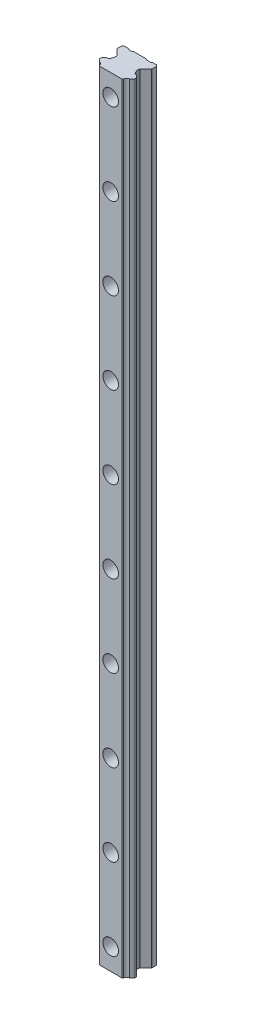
ISO-10303-21;
HEADER;
FILE_DESCRIPTION(('STEP AP214'),'2;1');
FILE_NAME('part.step','',(''),(''),'','','');
FILE_SCHEMA(('AUTOMOTIVE_DESIGN { 1 0 10303 214 1 1 1 1 }'));
ENDSEC;
DATA;
#1=APPLICATION_CONTEXT('core data for automotive mechanical design processes');
#2=APPLICATION_PROTOCOL_DEFINITION('international standard','automotive_design',2000,#1);
#3=PRODUCT_CONTEXT('',#1,'mechanical');
#4=PRODUCT('Part','Part','',(#3));
#5=PRODUCT_RELATED_PRODUCT_CATEGORY('part','',(#4));
#6=PRODUCT_DEFINITION_FORMATION('','',#4);
#7=PRODUCT_DEFINITION_CONTEXT('part definition',#1,'design');
#8=PRODUCT_DEFINITION('design','',#6,#7);
#9=PRODUCT_DEFINITION_SHAPE('','',#8);
#10=(LENGTH_UNIT() NAMED_UNIT(*) SI_UNIT(.MILLI.,.METRE.));
#11=(NAMED_UNIT(*) PLANE_ANGLE_UNIT() SI_UNIT($,.RADIAN.));
#12=(NAMED_UNIT(*) SI_UNIT($,.STERADIAN.) SOLID_ANGLE_UNIT());
#13=UNCERTAINTY_MEASURE_WITH_UNIT(LENGTH_MEASURE(1.E-05),#10,'distance_accuracy_value','');
#14=(GEOMETRIC_REPRESENTATION_CONTEXT(3) GLOBAL_UNCERTAINTY_ASSIGNED_CONTEXT((#13)) GLOBAL_UNIT_ASSIGNED_CONTEXT((#10,
#11,#12)) REPRESENTATION_CONTEXT('',''));
#15=CARTESIAN_POINT('',(0.,0.,0.));
#16=DIRECTION('',(0.,0.,1.));
#17=DIRECTION('',(1.,0.,0.));
#18=AXIS2_PLACEMENT_3D('',#15,#16,#17);
#19=CARTESIAN_POINT('',(0.,972.5,-17.));
#20=DIRECTION('',(0.,0.,-1.));
#21=DIRECTION('',(0.,-1.,0.));
#22=AXIS2_PLACEMENT_3D('',#19,#20,#21);
#23=PLANE('',#22);
#24=CARTESIAN_POINT('',(0.,972.5,-17.));
#25=DIRECTION('',(0.,0.,-1.));
#26=DIRECTION('',(0.,-1.,0.));
#27=AXIS2_PLACEMENT_3D('',#24,#25,#26);
#28=CIRCLE('',#27,7.);
#29=CARTESIAN_POINT('',(0.,965.5,-17.));
#30=VERTEX_POINT('',#29);
#31=EDGE_CURVE('E11',#30,#30,#28,.T.);
#32=ORIENTED_EDGE('',*,*,#31,.T.);
#33=EDGE_LOOP('',(#32));
#34=FACE_BOUND('',#33,.T.);
#35=CARTESIAN_POINT('',(0.,972.5,-17.));
#36=DIRECTION('',(0.,0.,1.));
#37=DIRECTION('',(0.,-1.,0.));
#38=AXIS2_PLACEMENT_3D('',#35,#36,#37);
#39=CIRCLE('',#38,10.);
#40=CARTESIAN_POINT('',(0.,962.5,-17.));
#41=VERTEX_POINT('',#40);
#42=EDGE_CURVE('E28',#41,#41,#39,.T.);
#43=ORIENTED_EDGE('',*,*,#42,.T.);
#44=EDGE_LOOP('',(#43));
#45=FACE_BOUND('',#44,.T.);
#46=ADVANCED_FACE('F17',(#34,#45),#23,.F.);
#47=CARTESIAN_POINT('',(0.,972.5,0.));
#48=DIRECTION('',(0.,0.,-1.));
#49=DIRECTION('',(0.,-1.,0.));
#50=AXIS2_PLACEMENT_3D('',#47,#48,#49);
#51=CYLINDRICAL_SURFACE('',#50,10.);
#52=ORIENTED_EDGE('',*,*,#42,.F.);
#53=EDGE_LOOP('',(#52));
#54=FACE_BOUND('',#53,.T.);
#55=CARTESIAN_POINT('',(0.,972.5,0.));
#56=DIRECTION('',(0.,0.,-1.));
#57=DIRECTION('',(0.,-1.,0.));
#58=AXIS2_PLACEMENT_3D('',#55,#56,#57);
#59=CIRCLE('',#58,10.);
#60=CARTESIAN_POINT('',(0.,962.5,0.));
#61=VERTEX_POINT('',#60);
#62=EDGE_CURVE('E704',#61,#61,#59,.T.);
#63=ORIENTED_EDGE('',*,*,#62,.F.);
#64=EDGE_LOOP('',(#63));
#65=FACE_BOUND('',#64,.T.);
#66=ADVANCED_FACE('F1222',(#54,#65),#51,.F.);
#67=CARTESIAN_POINT('',(0.,972.5,-17.));
#68=DIRECTION('',(0.,0.,-1.));
#69=DIRECTION('',(0.,-1.,0.));
#70=AXIS2_PLACEMENT_3D('',#67,#68,#69);
#71=CYLINDRICAL_SURFACE('',#70,7.);
#72=CARTESIAN_POINT('',(0.,972.5,-38.));
#73=DIRECTION('',(0.,0.,-1.));
#74=DIRECTION('',(-1.,0.,0.));
#75=AXIS2_PLACEMENT_3D('',#72,#73,#74);
#76=CIRCLE('',#75,7.);
#77=CARTESIAN_POINT('',(-7.,972.5,-38.));
#78=VERTEX_POINT('',#77);
#79=EDGE_CURVE('E826',#78,#78,#76,.T.);
#80=ORIENTED_EDGE('',*,*,#79,.T.);
#81=EDGE_LOOP('',(#80));
#82=FACE_BOUND('',#81,.T.);
#83=ORIENTED_EDGE('',*,*,#31,.F.);
#84=EDGE_LOOP('',(#83));
#85=FACE_BOUND('',#84,.T.);
#86=ADVANCED_FACE('F1229',(#82,#85),#71,.F.);
#87=CARTESIAN_POINT('',(0.,867.5,-17.));
#88=DIRECTION('',(0.,0.,-1.));
#89=DIRECTION('',(0.,-1.,0.));
#90=AXIS2_PLACEMENT_3D('',#87,#88,#89);
#91=PLANE('',#90);
#92=CARTESIAN_POINT('',(0.,867.5,-17.));
#93=DIRECTION('',(0.,0.,-1.));
#94=DIRECTION('',(0.,-1.,0.));
#95=AXIS2_PLACEMENT_3D('',#92,#93,#94);
#96=CIRCLE('',#95,7.);
#97=CARTESIAN_POINT('',(0.,860.5,-17.));
#98=VERTEX_POINT('',#97);
#99=EDGE_CURVE('E1095',#98,#98,#96,.T.);
#100=ORIENTED_EDGE('',*,*,#99,.T.);
#101=EDGE_LOOP('',(#100));
#102=FACE_BOUND('',#101,.T.);
#103=CARTESIAN_POINT('',(0.,867.5,-17.));
#104=DIRECTION('',(0.,0.,1.));
#105=DIRECTION('',(0.,-1.,0.));
#106=AXIS2_PLACEMENT_3D('',#103,#104,#105);
#107=CIRCLE('',#106,10.);
#108=CARTESIAN_POINT('',(0.,857.5,-17.));
#109=VERTEX_POINT('',#108);
#110=EDGE_CURVE('E996',#109,#109,#107,.T.);
#111=ORIENTED_EDGE('',*,*,#110,.T.);
#112=EDGE_LOOP('',(#111));
#113=FACE_BOUND('',#112,.T.);
#114=ADVANCED_FACE('F1282',(#102,#113),#91,.F.);
#115=CARTESIAN_POINT('',(0.,867.5,0.));
#116=DIRECTION('',(0.,0.,-1.));
#117=DIRECTION('',(0.,-1.,0.));
#118=AXIS2_PLACEMENT_3D('',#115,#116,#117);
#119=CYLINDRICAL_SURFACE('',#118,10.);
#120=ORIENTED_EDGE('',*,*,#110,.F.);
#121=EDGE_LOOP('',(#120));
#122=FACE_BOUND('',#121,.T.);
#123=CARTESIAN_POINT('',(0.,867.5,0.));
#124=DIRECTION('',(0.,0.,-1.));
#125=DIRECTION('',(0.,-1.,0.));
#126=AXIS2_PLACEMENT_3D('',#123,#124,#125);
#127=CIRCLE('',#126,10.);
#128=CARTESIAN_POINT('',(0.,857.5,0.));
#129=VERTEX_POINT('',#128);
#130=EDGE_CURVE('E700',#129,#129,#127,.T.);
#131=ORIENTED_EDGE('',*,*,#130,.F.);
#132=EDGE_LOOP('',(#131));
#133=FACE_BOUND('',#132,.T.);
#134=ADVANCED_FACE('F1272',(#122,#133),#119,.F.);
#135=CARTESIAN_POINT('',(0.,867.5,-17.));
#136=DIRECTION('',(0.,0.,-1.));
#137=DIRECTION('',(0.,-1.,0.));
#138=AXIS2_PLACEMENT_3D('',#135,#136,#137);
#139=CYLINDRICAL_SURFACE('',#138,7.);
#140=CARTESIAN_POINT('',(0.,867.5,-38.));
#141=DIRECTION('',(0.,0.,-1.));
#142=DIRECTION('',(-1.,0.,0.));
#143=AXIS2_PLACEMENT_3D('',#140,#141,#142);
#144=CIRCLE('',#143,7.);
#145=CARTESIAN_POINT('',(-7.,867.5,-38.));
#146=VERTEX_POINT('',#145);
#147=EDGE_CURVE('E779',#146,#146,#144,.T.);
#148=ORIENTED_EDGE('',*,*,#147,.T.);
#149=EDGE_LOOP('',(#148));
#150=FACE_BOUND('',#149,.T.);
#151=ORIENTED_EDGE('',*,*,#99,.F.);
#152=EDGE_LOOP('',(#151));
#153=FACE_BOUND('',#152,.T.);
#154=ADVANCED_FACE('F1269',(#150,#153),#139,.F.);
#155=CARTESIAN_POINT('',(0.,762.5,-17.));
#156=DIRECTION('',(0.,0.,-1.));
#157=DIRECTION('',(0.,-1.,0.));
#158=AXIS2_PLACEMENT_3D('',#155,#156,#157);
#159=PLANE('',#158);
#160=CARTESIAN_POINT('',(0.,762.5,-17.));
#161=DIRECTION('',(0.,0.,-1.));
#162=DIRECTION('',(0.,-1.,0.));
#163=AXIS2_PLACEMENT_3D('',#160,#161,#162);
#164=CIRCLE('',#163,7.);
#165=CARTESIAN_POINT('',(0.,755.5,-17.));
#166=VERTEX_POINT('',#165);
#167=EDGE_CURVE('E775',#166,#166,#164,.T.);
#168=ORIENTED_EDGE('',*,*,#167,.T.);
#169=EDGE_LOOP('',(#168));
#170=FACE_BOUND('',#169,.T.);
#171=CARTESIAN_POINT('',(0.,762.5,-17.));
#172=DIRECTION('',(0.,0.,1.));
#173=DIRECTION('',(0.,-1.,0.));
#174=AXIS2_PLACEMENT_3D('',#171,#172,#173);
#175=CIRCLE('',#174,10.);
#176=CARTESIAN_POINT('',(0.,752.5,-17.));
#177=VERTEX_POINT('',#176);
#178=EDGE_CURVE('E780',#177,#177,#175,.T.);
#179=ORIENTED_EDGE('',*,*,#178,.T.);
#180=EDGE_LOOP('',(#179));
#181=FACE_BOUND('',#180,.T.);
#182=ADVANCED_FACE('F19',(#170,#181),#159,.F.);
#183=CARTESIAN_POINT('',(0.,762.5,0.));
#184=DIRECTION('',(0.,0.,-1.));
#185=DIRECTION('',(0.,-1.,0.));
#186=AXIS2_PLACEMENT_3D('',#183,#184,#185);
#187=CYLINDRICAL_SURFACE('',#186,10.);
#188=ORIENTED_EDGE('',*,*,#178,.F.);
#189=EDGE_LOOP('',(#188));
#190=FACE_BOUND('',#189,.T.);
#191=CARTESIAN_POINT('',(0.,762.5,0.));
#192=DIRECTION('',(0.,0.,-1.));
#193=DIRECTION('',(0.,-1.,0.));
#194=AXIS2_PLACEMENT_3D('',#191,#192,#193);
#195=CIRCLE('',#194,10.);
#196=CARTESIAN_POINT('',(0.,752.5,0.));
#197=VERTEX_POINT('',#196);
#198=EDGE_CURVE('E705',#197,#197,#195,.T.);
#199=ORIENTED_EDGE('',*,*,#198,.F.);
#200=EDGE_LOOP('',(#199));
#201=FACE_BOUND('',#200,.T.);
#202=ADVANCED_FACE('F1395',(#190,#201),#187,.F.);
#203=CARTESIAN_POINT('',(0.,762.5,-17.));
#204=DIRECTION('',(0.,0.,-1.));
#205=DIRECTION('',(0.,-1.,0.));
#206=AXIS2_PLACEMENT_3D('',#203,#204,#205);
#207=CYLINDRICAL_SURFACE('',#206,7.);
#208=CARTESIAN_POINT('',(0.,762.5,-38.));
#209=DIRECTION('',(0.,0.,-1.));
#210=DIRECTION('',(-1.,0.,0.));
#211=AXIS2_PLACEMENT_3D('',#208,#209,#210);
#212=CIRCLE('',#211,7.);
#213=CARTESIAN_POINT('',(-7.,762.5,-38.));
#214=VERTEX_POINT('',#213);
#215=EDGE_CURVE('E1047',#214,#214,#212,.T.);
#216=ORIENTED_EDGE('',*,*,#215,.T.);
#217=EDGE_LOOP('',(#216));
#218=FACE_BOUND('',#217,.T.);
#219=ORIENTED_EDGE('',*,*,#167,.F.);
#220=EDGE_LOOP('',(#219));
#221=FACE_BOUND('',#220,.T.);
#222=ADVANCED_FACE('F1303',(#218,#221),#207,.F.);
#223=CARTESIAN_POINT('',(0.,657.5,-17.));
#224=DIRECTION('',(0.,0.,-1.));
#225=DIRECTION('',(0.,-1.,0.));
#226=AXIS2_PLACEMENT_3D('',#223,#224,#225);
#227=PLANE('',#226);
#228=CARTESIAN_POINT('',(0.,657.5,-17.));
#229=DIRECTION('',(0.,0.,-1.));
#230=DIRECTION('',(0.,-1.,0.));
#231=AXIS2_PLACEMENT_3D('',#228,#229,#230);
#232=CIRCLE('',#231,7.);
#233=CARTESIAN_POINT('',(0.,650.5,-17.));
#234=VERTEX_POINT('',#233);
#235=EDGE_CURVE('E1039',#234,#234,#232,.T.);
#236=ORIENTED_EDGE('',*,*,#235,.T.);
#237=EDGE_LOOP('',(#236));
#238=FACE_BOUND('',#237,.T.);
#239=CARTESIAN_POINT('',(0.,657.5,-17.));
#240=DIRECTION('',(0.,0.,1.));
#241=DIRECTION('',(0.,-1.,0.));
#242=AXIS2_PLACEMENT_3D('',#239,#240,#241);
#243=CIRCLE('',#242,10.);
#244=CARTESIAN_POINT('',(0.,647.5,-17.));
#245=VERTEX_POINT('',#244);
#246=EDGE_CURVE('E960',#245,#245,#243,.T.);
#247=ORIENTED_EDGE('',*,*,#246,.T.);
#248=EDGE_LOOP('',(#247));
#249=FACE_BOUND('',#248,.T.);
#250=ADVANCED_FACE('F1299',(#238,#249),#227,.F.);
#251=CARTESIAN_POINT('',(0.,657.5,0.));
#252=DIRECTION('',(0.,0.,-1.));
#253=DIRECTION('',(0.,-1.,0.));
#254=AXIS2_PLACEMENT_3D('',#251,#252,#253);
#255=CYLINDRICAL_SURFACE('',#254,10.);
#256=ORIENTED_EDGE('',*,*,#246,.F.);
#257=EDGE_LOOP('',(#256));
#258=FACE_BOUND('',#257,.T.);
#259=CARTESIAN_POINT('',(0.,657.5,0.));
#260=DIRECTION('',(0.,0.,-1.));
#261=DIRECTION('',(0.,-1.,0.));
#262=AXIS2_PLACEMENT_3D('',#259,#260,#261);
#263=CIRCLE('',#262,10.);
#264=CARTESIAN_POINT('',(0.,647.5,0.));
#265=VERTEX_POINT('',#264);
#266=EDGE_CURVE('E1029',#265,#265,#263,.T.);
#267=ORIENTED_EDGE('',*,*,#266,.F.);
#268=EDGE_LOOP('',(#267));
#269=FACE_BOUND('',#268,.T.);
#270=ADVANCED_FACE('F1302',(#258,#269),#255,.F.);
#271=CARTESIAN_POINT('',(0.,657.5,-17.));
#272=DIRECTION('',(0.,0.,-1.));
#273=DIRECTION('',(0.,-1.,0.));
#274=AXIS2_PLACEMENT_3D('',#271,#272,#273);
#275=CYLINDRICAL_SURFACE('',#274,7.);
#276=CARTESIAN_POINT('',(0.,657.5,-38.));
#277=DIRECTION('',(0.,0.,-1.));
#278=DIRECTION('',(-1.,0.,0.));
#279=AXIS2_PLACEMENT_3D('',#276,#277,#278);
#280=CIRCLE('',#279,7.);
#281=CARTESIAN_POINT('',(-7.,657.5,-38.));
#282=VERTEX_POINT('',#281);
#283=EDGE_CURVE('E956',#282,#282,#280,.T.);
#284=ORIENTED_EDGE('',*,*,#283,.T.);
#285=EDGE_LOOP('',(#284));
#286=FACE_BOUND('',#285,.T.);
#287=ORIENTED_EDGE('',*,*,#235,.F.);
#288=EDGE_LOOP('',(#287));
#289=FACE_BOUND('',#288,.T.);
#290=ADVANCED_FACE('F1322',(#286,#289),#275,.F.);
#291=CARTESIAN_POINT('',(0.,552.5,-17.));
#292=DIRECTION('',(0.,0.,-1.));
#293=DIRECTION('',(0.,-1.,0.));
#294=AXIS2_PLACEMENT_3D('',#291,#292,#293);
#295=PLANE('',#294);
#296=CARTESIAN_POINT('',(0.,552.5,-17.));
#297=DIRECTION('',(0.,0.,-1.));
#298=DIRECTION('',(0.,-1.,0.));
#299=AXIS2_PLACEMENT_3D('',#296,#297,#298);
#300=CIRCLE('',#299,7.);
#301=CARTESIAN_POINT('',(0.,545.5,-17.));
#302=VERTEX_POINT('',#301);
#303=EDGE_CURVE('E961',#302,#302,#300,.T.);
#304=ORIENTED_EDGE('',*,*,#303,.T.);
#305=EDGE_LOOP('',(#304));
#306=FACE_BOUND('',#305,.T.);
#307=CARTESIAN_POINT('',(0.,552.5,-17.));
#308=DIRECTION('',(0.,0.,1.));
#309=DIRECTION('',(0.,-1.,0.));
#310=AXIS2_PLACEMENT_3D('',#307,#308,#309);
#311=CIRCLE('',#310,10.);
#312=CARTESIAN_POINT('',(0.,542.5,-17.));
#313=VERTEX_POINT('',#312);
#314=EDGE_CURVE('E597',#313,#313,#311,.T.);
#315=ORIENTED_EDGE('',*,*,#314,.T.);
#316=EDGE_LOOP('',(#315));
#317=FACE_BOUND('',#316,.T.);
#318=ADVANCED_FACE('F1267',(#306,#317),#295,.F.);
#319=CARTESIAN_POINT('',(0.,552.5,0.));
#320=DIRECTION('',(0.,0.,-1.));
#321=DIRECTION('',(0.,-1.,0.));
#322=AXIS2_PLACEMENT_3D('',#319,#320,#321);
#323=CYLINDRICAL_SURFACE('',#322,10.);
#324=ORIENTED_EDGE('',*,*,#314,.F.);
#325=EDGE_LOOP('',(#324));
#326=FACE_BOUND('',#325,.T.);
#327=CARTESIAN_POINT('',(0.,552.5,0.));
#328=DIRECTION('',(0.,0.,-1.));
#329=DIRECTION('',(0.,-1.,0.));
#330=AXIS2_PLACEMENT_3D('',#327,#328,#329);
#331=CIRCLE('',#330,10.);
#332=CARTESIAN_POINT('',(0.,542.5,0.));
#333=VERTEX_POINT('',#332);
#334=EDGE_CURVE('E603',#333,#333,#331,.T.);
#335=ORIENTED_EDGE('',*,*,#334,.F.);
#336=EDGE_LOOP('',(#335));
#337=FACE_BOUND('',#336,.T.);
#338=ADVANCED_FACE('F1263',(#326,#337),#323,.F.);
#339=CARTESIAN_POINT('',(0.,552.5,-17.));
#340=DIRECTION('',(0.,0.,-1.));
#341=DIRECTION('',(0.,-1.,0.));
#342=AXIS2_PLACEMENT_3D('',#339,#340,#341);
#343=CYLINDRICAL_SURFACE('',#342,7.);
#344=CARTESIAN_POINT('',(0.,552.5,-38.));
#345=DIRECTION('',(0.,0.,-1.));
#346=DIRECTION('',(-1.,0.,0.));
#347=AXIS2_PLACEMENT_3D('',#344,#345,#346);
#348=CIRCLE('',#347,7.);
#349=CARTESIAN_POINT('',(-7.,552.5,-38.));
#350=VERTEX_POINT('',#349);
#351=EDGE_CURVE('E593',#350,#350,#348,.T.);
#352=ORIENTED_EDGE('',*,*,#351,.T.);
#353=EDGE_LOOP('',(#352));
#354=FACE_BOUND('',#353,.T.);
#355=ORIENTED_EDGE('',*,*,#303,.F.);
#356=EDGE_LOOP('',(#355));
#357=FACE_BOUND('',#356,.T.);
#358=ADVANCED_FACE('F1266',(#354,#357),#343,.F.);
#359=CARTESIAN_POINT('',(0.,447.5,-17.));
#360=DIRECTION('',(0.,0.,-1.));
#361=DIRECTION('',(0.,-1.,0.));
#362=AXIS2_PLACEMENT_3D('',#359,#360,#361);
#363=PLANE('',#362);
#364=CARTESIAN_POINT('',(0.,447.5,-17.));
#365=DIRECTION('',(0.,0.,-1.));
#366=DIRECTION('',(0.,-1.,0.));
#367=AXIS2_PLACEMENT_3D('',#364,#365,#366);
#368=CIRCLE('',#367,7.);
#369=CARTESIAN_POINT('',(0.,440.5,-17.));
#370=VERTEX_POINT('',#369);
#371=EDGE_CURVE('E598',#370,#370,#368,.T.);
#372=ORIENTED_EDGE('',*,*,#371,.T.);
#373=EDGE_LOOP('',(#372));
#374=FACE_BOUND('',#373,.T.);
#375=CARTESIAN_POINT('',(0.,447.5,-17.));
#376=DIRECTION('',(0.,0.,1.));
#377=DIRECTION('',(0.,-1.,0.));
#378=AXIS2_PLACEMENT_3D('',#375,#376,#377);
#379=CIRCLE('',#378,10.);
#380=CARTESIAN_POINT('',(0.,437.5,-17.));
#381=VERTEX_POINT('',#380);
#382=EDGE_CURVE('E914',#381,#381,#379,.T.);
#383=ORIENTED_EDGE('',*,*,#382,.T.);
#384=EDGE_LOOP('',(#383));
#385=FACE_BOUND('',#384,.T.);
#386=ADVANCED_FACE('F1342',(#374,#385),#363,.F.);
#387=CARTESIAN_POINT('',(0.,447.5,0.));
#388=DIRECTION('',(0.,0.,-1.));
#389=DIRECTION('',(0.,-1.,0.));
#390=AXIS2_PLACEMENT_3D('',#387,#388,#389);
#391=CYLINDRICAL_SURFACE('',#390,10.);
#392=ORIENTED_EDGE('',*,*,#382,.F.);
#393=EDGE_LOOP('',(#392));
#394=FACE_BOUND('',#393,.T.);
#395=CARTESIAN_POINT('',(0.,447.5,0.));
#396=DIRECTION('',(0.,0.,-1.));
#397=DIRECTION('',(0.,-1.,0.));
#398=AXIS2_PLACEMENT_3D('',#395,#396,#397);
#399=CIRCLE('',#398,10.);
#400=CARTESIAN_POINT('',(0.,437.5,0.));
#401=VERTEX_POINT('',#400);
#402=EDGE_CURVE('E599',#401,#401,#399,.T.);
#403=ORIENTED_EDGE('',*,*,#402,.F.);
#404=EDGE_LOOP('',(#403));
#405=FACE_BOUND('',#404,.T.);
#406=ADVANCED_FACE('F1345',(#394,#405),#391,.F.);
#407=CARTESIAN_POINT('',(0.,447.5,-17.));
#408=DIRECTION('',(0.,0.,-1.));
#409=DIRECTION('',(0.,-1.,0.));
#410=AXIS2_PLACEMENT_3D('',#407,#408,#409);
#411=CYLINDRICAL_SURFACE('',#410,7.);
#412=CARTESIAN_POINT('',(0.,447.5,-38.));
#413=DIRECTION('',(0.,0.,-1.));
#414=DIRECTION('',(-1.,0.,0.));
#415=AXIS2_PLACEMENT_3D('',#412,#413,#414);
#416=CIRCLE('',#415,7.);
#417=CARTESIAN_POINT('',(-7.,447.5,-38.));
#418=VERTEX_POINT('',#417);
#419=EDGE_CURVE('E976',#418,#418,#416,.T.);
#420=ORIENTED_EDGE('',*,*,#419,.T.);
#421=EDGE_LOOP('',(#420));
#422=FACE_BOUND('',#421,.T.);
#423=ORIENTED_EDGE('',*,*,#371,.F.);
#424=EDGE_LOOP('',(#423));
#425=FACE_BOUND('',#424,.T.);
#426=ADVANCED_FACE('F1390',(#422,#425),#411,.F.);
#427=CARTESIAN_POINT('',(0.,342.5,-17.));
#428=DIRECTION('',(0.,0.,-1.));
#429=DIRECTION('',(0.,-1.,0.));
#430=AXIS2_PLACEMENT_3D('',#427,#428,#429);
#431=PLANE('',#430);
#432=CARTESIAN_POINT('',(0.,342.5,-17.));
#433=DIRECTION('',(0.,0.,-1.));
#434=DIRECTION('',(0.,-1.,0.));
#435=AXIS2_PLACEMENT_3D('',#432,#433,#434);
#436=CIRCLE('',#435,7.);
#437=CARTESIAN_POINT('',(0.,335.5,-17.));
#438=VERTEX_POINT('',#437);
#439=EDGE_CURVE('E977',#438,#438,#436,.T.);
#440=ORIENTED_EDGE('',*,*,#439,.T.);
#441=EDGE_LOOP('',(#440));
#442=FACE_BOUND('',#441,.T.);
#443=CARTESIAN_POINT('',(0.,342.5,-17.));
#444=DIRECTION('',(0.,0.,1.));
#445=DIRECTION('',(0.,-1.,0.));
#446=AXIS2_PLACEMENT_3D('',#443,#444,#445);
#447=CIRCLE('',#446,10.);
#448=CARTESIAN_POINT('',(0.,332.5,-17.));
#449=VERTEX_POINT('',#448);
#450=EDGE_CURVE('E316',#449,#449,#447,.T.);
#451=ORIENTED_EDGE('',*,*,#450,.T.);
#452=EDGE_LOOP('',(#451));
#453=FACE_BOUND('',#452,.T.);
#454=ADVANCED_FACE('F1393',(#442,#453),#431,.F.);
#455=CARTESIAN_POINT('',(0.,342.5,0.));
#456=DIRECTION('',(0.,0.,-1.));
#457=DIRECTION('',(0.,-1.,0.));
#458=AXIS2_PLACEMENT_3D('',#455,#456,#457);
#459=CYLINDRICAL_SURFACE('',#458,10.);
#460=ORIENTED_EDGE('',*,*,#450,.F.);
#461=EDGE_LOOP('',(#460));
#462=FACE_BOUND('',#461,.T.);
#463=CARTESIAN_POINT('',(0.,342.5,0.));
#464=DIRECTION('',(0.,0.,-1.));
#465=DIRECTION('',(0.,-1.,0.));
#466=AXIS2_PLACEMENT_3D('',#463,#464,#465);
#467=CIRCLE('',#466,10.);
#468=CARTESIAN_POINT('',(0.,332.5,0.));
#469=VERTEX_POINT('',#468);
#470=EDGE_CURVE('E328',#469,#469,#467,.T.);
#471=ORIENTED_EDGE('',*,*,#470,.F.);
#472=EDGE_LOOP('',(#471));
#473=FACE_BOUND('',#472,.T.);
#474=ADVANCED_FACE('F2251',(#462,#473),#459,.F.);
#475=CARTESIAN_POINT('',(0.,342.5,-17.));
#476=DIRECTION('',(0.,0.,-1.));
#477=DIRECTION('',(0.,-1.,0.));
#478=AXIS2_PLACEMENT_3D('',#475,#476,#477);
#479=CYLINDRICAL_SURFACE('',#478,7.);
#480=CARTESIAN_POINT('',(0.,342.5,-38.));
#481=DIRECTION('',(0.,0.,-1.));
#482=DIRECTION('',(-1.,0.,0.));
#483=AXIS2_PLACEMENT_3D('',#480,#481,#482);
#484=CIRCLE('',#483,7.);
#485=CARTESIAN_POINT('',(-7.,342.5,-38.));
#486=VERTEX_POINT('',#485);
#487=EDGE_CURVE('E784',#486,#486,#484,.T.);
#488=ORIENTED_EDGE('',*,*,#487,.T.);
#489=EDGE_LOOP('',(#488));
#490=FACE_BOUND('',#489,.T.);
#491=ORIENTED_EDGE('',*,*,#439,.F.);
#492=EDGE_LOOP('',(#491));
#493=FACE_BOUND('',#492,.T.);
#494=ADVANCED_FACE('F1353',(#490,#493),#479,.F.);
#495=CARTESIAN_POINT('',(0.,237.5,-17.));
#496=DIRECTION('',(0.,0.,-1.));
#497=DIRECTION('',(0.,-1.,0.));
#498=AXIS2_PLACEMENT_3D('',#495,#496,#497);
#499=PLANE('',#498);
#500=CARTESIAN_POINT('',(0.,237.5,-17.));
#501=DIRECTION('',(0.,0.,-1.));
#502=DIRECTION('',(0.,-1.,0.));
#503=AXIS2_PLACEMENT_3D('',#500,#501,#502);
#504=CIRCLE('',#503,7.);
#505=CARTESIAN_POINT('',(0.,230.5,-17.));
#506=VERTEX_POINT('',#505);
#507=EDGE_CURVE('E676',#506,#506,#504,.T.);
#508=ORIENTED_EDGE('',*,*,#507,.T.);
#509=EDGE_LOOP('',(#508));
#510=FACE_BOUND('',#509,.T.);
#511=CARTESIAN_POINT('',(0.,237.5,-17.));
#512=DIRECTION('',(0.,0.,1.));
#513=DIRECTION('',(0.,-1.,0.));
#514=AXIS2_PLACEMENT_3D('',#511,#512,#513);
#515=CIRCLE('',#514,10.);
#516=CARTESIAN_POINT('',(0.,227.5,-17.));
#517=VERTEX_POINT('',#516);
#518=EDGE_CURVE('E672',#517,#517,#515,.T.);
#519=ORIENTED_EDGE('',*,*,#518,.T.);
#520=EDGE_LOOP('',(#519));
#521=FACE_BOUND('',#520,.T.);
#522=ADVANCED_FACE('F1246',(#510,#521),#499,.F.);
#523=CARTESIAN_POINT('',(0.,237.5,0.));
#524=DIRECTION('',(0.,0.,-1.));
#525=DIRECTION('',(0.,-1.,0.));
#526=AXIS2_PLACEMENT_3D('',#523,#524,#525);
#527=CYLINDRICAL_SURFACE('',#526,10.);
#528=ORIENTED_EDGE('',*,*,#518,.F.);
#529=EDGE_LOOP('',(#528));
#530=FACE_BOUND('',#529,.T.);
#531=CARTESIAN_POINT('',(0.,237.5,0.));
#532=DIRECTION('',(0.,0.,-1.));
#533=DIRECTION('',(0.,-1.,0.));
#534=AXIS2_PLACEMENT_3D('',#531,#532,#533);
#535=CIRCLE('',#534,10.);
#536=CARTESIAN_POINT('',(0.,227.5,0.));
#537=VERTEX_POINT('',#536);
#538=EDGE_CURVE('E710',#537,#537,#535,.T.);
#539=ORIENTED_EDGE('',*,*,#538,.F.);
#540=EDGE_LOOP('',(#539));
#541=FACE_BOUND('',#540,.T.);
#542=ADVANCED_FACE('F1242',(#530,#541),#527,.F.);
#543=CARTESIAN_POINT('',(0.,237.5,-17.));
#544=DIRECTION('',(0.,0.,-1.));
#545=DIRECTION('',(0.,-1.,0.));
#546=AXIS2_PLACEMENT_3D('',#543,#544,#545);
#547=CYLINDRICAL_SURFACE('',#546,7.);
#548=CARTESIAN_POINT('',(0.,237.5,-38.));
#549=DIRECTION('',(0.,0.,-1.));
#550=DIRECTION('',(-1.,0.,0.));
#551=AXIS2_PLACEMENT_3D('',#548,#549,#550);
#552=CIRCLE('',#551,7.);
#553=CARTESIAN_POINT('',(-7.,237.5,-38.));
#554=VERTEX_POINT('',#553);
#555=EDGE_CURVE('E677',#554,#554,#552,.T.);
#556=ORIENTED_EDGE('',*,*,#555,.T.);
#557=EDGE_LOOP('',(#556));
#558=FACE_BOUND('',#557,.T.);
#559=ORIENTED_EDGE('',*,*,#507,.F.);
#560=EDGE_LOOP('',(#559));
#561=FACE_BOUND('',#560,.T.);
#562=ADVANCED_FACE('F1245',(#558,#561),#547,.F.);
#563=CARTESIAN_POINT('',(0.,132.5,-17.));
#564=DIRECTION('',(0.,0.,-1.));
#565=DIRECTION('',(0.,-1.,0.));
#566=AXIS2_PLACEMENT_3D('',#563,#564,#565);
#567=PLANE('',#566);
#568=CARTESIAN_POINT('',(0.,132.5,-17.));
#569=DIRECTION('',(0.,0.,-1.));
#570=DIRECTION('',(0.,-1.,0.));
#571=AXIS2_PLACEMENT_3D('',#568,#569,#570);
#572=CIRCLE('',#571,7.);
#573=CARTESIAN_POINT('',(0.,125.5,-17.));
#574=VERTEX_POINT('',#573);
#575=EDGE_CURVE('E930',#574,#574,#572,.T.);
#576=ORIENTED_EDGE('',*,*,#575,.T.);
#577=EDGE_LOOP('',(#576));
#578=FACE_BOUND('',#577,.T.);
#579=CARTESIAN_POINT('',(0.,132.5,-17.));
#580=DIRECTION('',(0.,0.,1.));
#581=DIRECTION('',(0.,-1.,0.));
#582=AXIS2_PLACEMENT_3D('',#579,#580,#581);
#583=CIRCLE('',#582,10.);
#584=CARTESIAN_POINT('',(0.,122.5,-17.));
#585=VERTEX_POINT('',#584);
#586=EDGE_CURVE('E926',#585,#585,#583,.T.);
#587=ORIENTED_EDGE('',*,*,#586,.T.);
#588=EDGE_LOOP('',(#587));
#589=FACE_BOUND('',#588,.T.);
#590=ADVANCED_FACE('F1312',(#578,#589),#567,.F.);
#591=CARTESIAN_POINT('',(0.,132.5,0.));
#592=DIRECTION('',(0.,0.,-1.));
#593=DIRECTION('',(0.,-1.,0.));
#594=AXIS2_PLACEMENT_3D('',#591,#592,#593);
#595=CYLINDRICAL_SURFACE('',#594,10.);
#596=ORIENTED_EDGE('',*,*,#586,.F.);
#597=EDGE_LOOP('',(#596));
#598=FACE_BOUND('',#597,.T.);
#599=CARTESIAN_POINT('',(0.,132.5,0.));
#600=DIRECTION('',(0.,0.,-1.));
#601=DIRECTION('',(0.,-1.,0.));
#602=AXIS2_PLACEMENT_3D('',#599,#600,#601);
#603=CIRCLE('',#602,10.);
#604=CARTESIAN_POINT('',(0.,122.5,0.));
#605=VERTEX_POINT('',#604);
#606=EDGE_CURVE('E706',#605,#605,#603,.T.);
#607=ORIENTED_EDGE('',*,*,#606,.F.);
#608=EDGE_LOOP('',(#607));
#609=FACE_BOUND('',#608,.T.);
#610=ADVANCED_FACE('F1315',(#598,#609),#595,.F.);
#611=CARTESIAN_POINT('',(0.,132.5,-17.));
#612=DIRECTION('',(0.,0.,-1.));
#613=DIRECTION('',(0.,-1.,0.));
#614=AXIS2_PLACEMENT_3D('',#611,#612,#613);
#615=CYLINDRICAL_SURFACE('',#614,7.);
#616=CARTESIAN_POINT('',(0.,132.5,-38.));
#617=DIRECTION('',(0.,0.,-1.));
#618=DIRECTION('',(-1.,0.,0.));
#619=AXIS2_PLACEMENT_3D('',#616,#617,#618);
#620=CIRCLE('',#619,7.);
#621=CARTESIAN_POINT('',(-7.,132.5,-38.));
#622=VERTEX_POINT('',#621);
#623=EDGE_CURVE('E931',#622,#622,#620,.T.);
#624=ORIENTED_EDGE('',*,*,#623,.T.);
#625=EDGE_LOOP('',(#624));
#626=FACE_BOUND('',#625,.T.);
#627=ORIENTED_EDGE('',*,*,#575,.F.);
#628=EDGE_LOOP('',(#627));
#629=FACE_BOUND('',#628,.T.);
#630=ADVANCED_FACE('F1349',(#626,#629),#615,.F.);
#631=CARTESIAN_POINT('',(-32.5,1000.,0.));
#632=DIRECTION('',(0.,0.,-1.));
#633=DIRECTION('',(0.,-1.,0.));
#634=AXIS2_PLACEMENT_3D('',#631,#632,#633);
#635=PLANE('',#634);
#636=ORIENTED_EDGE('',*,*,#62,.T.);
#637=EDGE_LOOP('',(#636));
#638=FACE_BOUND('',#637,.T.);
#639=ORIENTED_EDGE('',*,*,#130,.T.);
#640=EDGE_LOOP('',(#639));
#641=FACE_BOUND('',#640,.T.);
#642=ORIENTED_EDGE('',*,*,#198,.T.);
#643=EDGE_LOOP('',(#642));
#644=FACE_BOUND('',#643,.T.);
#645=ORIENTED_EDGE('',*,*,#266,.T.);
#646=EDGE_LOOP('',(#645));
#647=FACE_BOUND('',#646,.T.);
#648=ORIENTED_EDGE('',*,*,#334,.T.);
#649=EDGE_LOOP('',(#648));
#650=FACE_BOUND('',#649,.T.);
#651=ORIENTED_EDGE('',*,*,#402,.T.);
#652=EDGE_LOOP('',(#651));
#653=FACE_BOUND('',#652,.T.);
#654=ORIENTED_EDGE('',*,*,#470,.T.);
#655=EDGE_LOOP('',(#654));
#656=FACE_BOUND('',#655,.T.);
#657=ORIENTED_EDGE('',*,*,#538,.T.);
#658=EDGE_LOOP('',(#657));
#659=FACE_BOUND('',#658,.T.);
#660=ORIENTED_EDGE('',*,*,#606,.T.);
#661=EDGE_LOOP('',(#660));
#662=FACE_BOUND('',#661,.T.);
#663=CARTESIAN_POINT('',(0.,27.5,0.));
#664=DIRECTION('',(0.,0.,-1.));
#665=DIRECTION('',(0.,-1.,0.));
#666=AXIS2_PLACEMENT_3D('',#663,#664,#665);
#667=CIRCLE('',#666,10.);
#668=CARTESIAN_POINT('',(0.,17.5,0.));
#669=VERTEX_POINT('',#668);
#670=EDGE_CURVE('E711',#669,#669,#667,.T.);
#671=ORIENTED_EDGE('',*,*,#670,.T.);
#672=EDGE_LOOP('',(#671));
#673=FACE_BOUND('',#672,.T.);
#674=DIRECTION('',(0.,-1.,0.));
#675=VECTOR('',#674,1.);
#676=CARTESIAN_POINT('',(-14.5817484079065,1003.61845339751,0.));
#677=LINE('',#676,#675);
#678=CARTESIAN_POINT('',(-14.5817484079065,1000.,0.));
#679=VERTEX_POINT('',#678);
#680=CARTESIAN_POINT('',(-14.5817484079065,0.,0.));
#681=VERTEX_POINT('',#680);
#682=EDGE_CURVE('E836',#679,#681,#677,.T.);
#683=ORIENTED_EDGE('',*,*,#682,.T.);
#684=DIRECTION('',(1.,0.,0.));
#685=VECTOR('',#684,1.);
#686=CARTESIAN_POINT('',(-32.5,0.,0.));
#687=LINE('',#686,#685);
#688=CARTESIAN_POINT('',(14.5817484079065,0.,0.));
#689=VERTEX_POINT('',#688);
#690=EDGE_CURVE('E840',#681,#689,#687,.T.);
#691=ORIENTED_EDGE('',*,*,#690,.T.);
#692=DIRECTION('',(0.,-1.,0.));
#693=VECTOR('',#692,1.);
#694=CARTESIAN_POINT('',(14.5817484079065,1003.61845339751,0.));
#695=LINE('',#694,#693);
#696=CARTESIAN_POINT('',(14.5817484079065,1000.,0.));
#697=VERTEX_POINT('',#696);
#698=EDGE_CURVE('E816',#697,#689,#695,.T.);
#699=ORIENTED_EDGE('',*,*,#698,.F.);
#700=DIRECTION('',(1.,0.,0.));
#701=VECTOR('',#700,1.);
#702=CARTESIAN_POINT('',(-32.5,1000.,0.));
#703=LINE('',#702,#701);
#704=EDGE_CURVE('E751',#679,#697,#703,.T.);
#705=ORIENTED_EDGE('',*,*,#704,.F.);
#706=EDGE_LOOP('',(#683,#691,#699,#705));
#707=FACE_BOUND('',#706,.T.);
#708=ADVANCED_FACE('F1307',(#638,#641,#644,#647,#650,#653,#656,#659,#662,#673,#707),#635,.F.);
#709=CARTESIAN_POINT('',(0.,1000.,0.));
#710=DIRECTION('',(0.,1.,0.));
#711=DIRECTION('',(1.,0.,0.));
#712=AXIS2_PLACEMENT_3D('',#709,#710,#711);
#713=PLANE('',#712);
#714=CARTESIAN_POINT('',(-19.2607173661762,1000.,-0.834582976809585));
#715=DIRECTION('',(0.,-1.,0.));
#716=DIRECTION('',(0.,0.,1.));
#717=AXIS2_PLACEMENT_3D('',#714,#715,#716);
#718=CIRCLE('',#717,3.99999999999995);
#719=CARTESIAN_POINT('',(-19.1621414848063,1000.,-4.83336814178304));
#720=VERTEX_POINT('',#719);
#721=CARTESIAN_POINT('',(-15.2668927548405,1000.,-1.05676527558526));
#722=VERTEX_POINT('',#721);
#723=EDGE_CURVE('E1085',#720,#722,#718,.T.);
#724=ORIENTED_EDGE('',*,*,#723,.T.);
#725=DIRECTION('',(0.544009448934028,0.,0.839079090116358));
#726=VECTOR('',#725,1.);
#727=CARTESIAN_POINT('',(-10.2663342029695,1000.,6.65608627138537));
#728=LINE('',#727,#726);
#729=EDGE_CURVE('E1081',#722,#679,#728,.T.);
#730=ORIENTED_EDGE('',*,*,#729,.T.);
#731=ORIENTED_EDGE('',*,*,#704,.T.);
#732=DIRECTION('',(0.707106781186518,0.,-0.707106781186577));
#733=VECTOR('',#732,1.);
#734=CARTESIAN_POINT('',(7.29087420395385,1000.,7.29087420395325));
#735=LINE('',#734,#733);
#736=CARTESIAN_POINT('',(15.4038880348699,1000.,-0.822139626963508));
#737=VERTEX_POINT('',#736);
#738=EDGE_CURVE('E748',#697,#737,#735,.T.);
#739=ORIENTED_EDGE('',*,*,#738,.T.);
#740=CARTESIAN_POINT('',(19.4038686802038,1000.,-0.834582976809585));
#741=DIRECTION('',(0.,-1.,0.));
#742=DIRECTION('',(0.,0.,1.));
#743=AXIS2_PLACEMENT_3D('',#740,#741,#742);
#744=CIRCLE('',#743,4.00000000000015);
#745=CARTESIAN_POINT('',(19.3052927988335,1000.,-4.83336814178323));
#746=VERTEX_POINT('',#745);
#747=EDGE_CURVE('E752',#737,#746,#744,.T.);
#748=ORIENTED_EDGE('',*,*,#747,.T.);
#749=DIRECTION('',(0.707106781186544,0.,-0.707106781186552));
#750=VECTOR('',#749,1.);
#751=CARTESIAN_POINT('',(7.23596232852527,1000.,7.23596232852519));
#752=LINE('',#751,#750);
#753=CARTESIAN_POINT('',(22.3372610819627,1000.,-7.8653364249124));
#754=VERTEX_POINT('',#753);
#755=EDGE_CURVE('E992',#746,#754,#752,.T.);
#756=ORIENTED_EDGE('',*,*,#755,.T.);
#757=CARTESIAN_POINT('',(21.7715756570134,1000.,-8.43102184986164));
#758=DIRECTION('',(0.,1.,0.));
#759=DIRECTION('',(0.,0.,1.));
#760=AXIS2_PLACEMENT_3D('',#757,#758,#759);
#761=CIRCLE('',#760,0.8);
#762=CARTESIAN_POINT('',(22.5715756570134,1000.,-8.43102184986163));
#763=VERTEX_POINT('',#762);
#764=EDGE_CURVE('E939',#754,#763,#761,.T.);
#765=ORIENTED_EDGE('',*,*,#764,.T.);
#766=DIRECTION('',(0.,0.,-1.));
#767=VECTOR('',#766,1.);
#768=CARTESIAN_POINT('',(22.5715756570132,1000.,6.75876410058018E-13));
#769=LINE('',#768,#767);
#770=CARTESIAN_POINT('',(22.5715756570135,1000.,-10.1690071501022));
#771=VERTEX_POINT('',#770);
#772=EDGE_CURVE('E936',#763,#771,#769,.T.);
#773=ORIENTED_EDGE('',*,*,#772,.T.);
#774=CARTESIAN_POINT('',(21.7715756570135,1000.,-10.1690071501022));
#775=DIRECTION('',(0.,1.,0.));
#776=DIRECTION('',(0.,0.,1.));
#777=AXIS2_PLACEMENT_3D('',#774,#775,#776);
#778=CIRCLE('',#777,0.8);
#779=CARTESIAN_POINT('',(22.3372610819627,1000.,-10.7346925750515));
#780=VERTEX_POINT('',#779);
#781=EDGE_CURVE('E633',#771,#780,#778,.T.);
#782=ORIENTED_EDGE('',*,*,#781,.T.);
#783=DIRECTION('',(-0.707106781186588,0.,-0.707106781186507));
#784=VECTOR('',#783,1.);
#785=CARTESIAN_POINT('',(16.5359768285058,1000.,-16.5359768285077));
#786=LINE('',#785,#784);
#787=CARTESIAN_POINT('',(19.306324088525,1000.,-13.7656295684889));
#788=VERTEX_POINT('',#787);
#789=EDGE_CURVE('E629',#780,#788,#786,.T.);
#790=ORIENTED_EDGE('',*,*,#789,.T.);
#791=CARTESIAN_POINT('',(19.4038686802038,1000.,-17.7644400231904));
#792=DIRECTION('',(0.,-1.,0.));
#793=DIRECTION('',(0.,0.,1.));
#794=AXIS2_PLACEMENT_3D('',#791,#792,#793);
#795=CIRCLE('',#794,3.9999999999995);
#796=CARTESIAN_POINT('',(15.4050582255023,1000.,-17.6668954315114));
#797=VERTEX_POINT('',#796);
#798=EDGE_CURVE('E634',#788,#797,#795,.T.);
#799=ORIENTED_EDGE('',*,*,#798,.T.);
#800=DIRECTION('',(-0.707106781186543,0.,-0.707106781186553));
#801=VECTOR('',#800,1.);
#802=CARTESIAN_POINT('',(16.535976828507,1000.,-16.5359768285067));
#803=LINE('',#802,#801);
#804=CARTESIAN_POINT('',(14.92304751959,1000.,-18.1489061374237));
#805=VERTEX_POINT('',#804);
#806=EDGE_CURVE('E757',#797,#805,#803,.T.);
#807=ORIENTED_EDGE('',*,*,#806,.T.);
#808=CARTESIAN_POINT('',(15.7715756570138,1000.,-18.9974342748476));
#809=DIRECTION('',(0.,-1.,0.));
#810=DIRECTION('',(0.,0.,1.));
#811=AXIS2_PLACEMENT_3D('',#808,#809,#810);
#812=CIRCLE('',#811,1.2);
#813=CARTESIAN_POINT('',(14.5715756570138,1000.,-18.9974342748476));
#814=VERTEX_POINT('',#813);
#815=EDGE_CURVE('E556',#805,#814,#812,.T.);
#816=ORIENTED_EDGE('',*,*,#815,.T.);
#817=DIRECTION('',(0.,0.,-1.));
#818=VECTOR('',#817,1.);
#819=CARTESIAN_POINT('',(14.5715756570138,1000.,0.));
#820=LINE('',#819,#818);
#821=CARTESIAN_POINT('',(14.5715756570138,1000.,-22.0026171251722));
#822=VERTEX_POINT('',#821);
#823=EDGE_CURVE('E549',#814,#822,#820,.T.);
#824=ORIENTED_EDGE('',*,*,#823,.T.);
#825=CARTESIAN_POINT('',(15.7715756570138,1000.,-22.0026171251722));
#826=DIRECTION('',(0.,-1.,0.));
#827=DIRECTION('',(0.,0.,1.));
#828=AXIS2_PLACEMENT_3D('',#825,#826,#827);
#829=CIRCLE('',#828,1.2);
#830=CARTESIAN_POINT('',(14.92304751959,1000.,-22.851145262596));
#831=VERTEX_POINT('',#830);
#832=EDGE_CURVE('E540',#822,#831,#829,.T.);
#833=ORIENTED_EDGE('',*,*,#832,.T.);
#834=DIRECTION('',(0.707106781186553,0.,-0.707106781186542));
#835=VECTOR('',#834,1.);
#836=CARTESIAN_POINT('',(-3.96404887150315,1000.,-3.96404887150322));
#837=LINE('',#836,#835);
#838=CARTESIAN_POINT('',(22.2201037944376,1000.,-30.1482015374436));
#839=VERTEX_POINT('',#838);
#840=EDGE_CURVE('E550',#831,#839,#837,.T.);
#841=ORIENTED_EDGE('',*,*,#840,.T.);
#842=CARTESIAN_POINT('',(21.3715756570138,1000.,-30.9967296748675));
#843=DIRECTION('',(0.,1.,0.));
#844=DIRECTION('',(0.,0.,1.));
#845=AXIS2_PLACEMENT_3D('',#842,#843,#844);
#846=CIRCLE('',#845,1.2);
#847=CARTESIAN_POINT('',(22.5715756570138,1000.,-30.9967296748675));
#848=VERTEX_POINT('',#847);
#849=EDGE_CURVE('E730',#839,#848,#846,.T.);
#850=ORIENTED_EDGE('',*,*,#849,.T.);
#851=DIRECTION('',(0.,0.,-1.));
#852=VECTOR('',#851,1.);
#853=CARTESIAN_POINT('',(22.5715756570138,1000.,0.));
#854=LINE('',#853,#852);
#855=CARTESIAN_POINT('',(22.5715756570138,1000.,-36.5));
#856=VERTEX_POINT('',#855);
#857=EDGE_CURVE('E758',#848,#856,#854,.T.);
#858=ORIENTED_EDGE('',*,*,#857,.T.);
#859=DIRECTION('',(-0.707106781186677,0.,-0.707106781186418));
#860=VECTOR('',#859,1.);
#861=CARTESIAN_POINT('',(29.5357878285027,1000.,-29.5357878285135));
#862=LINE('',#861,#860);
#863=CARTESIAN_POINT('',(21.0715756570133,1000.,-38.));
#864=VERTEX_POINT('',#863);
#865=EDGE_CURVE('E762',#856,#864,#862,.T.);
#866=ORIENTED_EDGE('',*,*,#865,.T.);
#867=DIRECTION('',(-1.,0.,0.));
#868=VECTOR('',#867,1.);
#869=CARTESIAN_POINT('',(0.,1000.,-38.));
#870=LINE('',#869,#868);
#871=CARTESIAN_POINT('',(15.321197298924,1000.,-38.));
#872=VERTEX_POINT('',#871);
#873=EDGE_CURVE('E1005',#864,#872,#870,.T.);
#874=ORIENTED_EDGE('',*,*,#873,.T.);
#875=DIRECTION('',(-0.707106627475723,0.,0.707106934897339));
#876=VECTOR('',#875,1.);
#877=CARTESIAN_POINT('',(-11.3393980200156,1000.,-11.3393930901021));
#878=LINE('',#877,#876);
#879=CARTESIAN_POINT('',(14.3211975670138,1000.,-36.9999998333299));
#880=VERTEX_POINT('',#879);
#881=EDGE_CURVE('E789',#872,#880,#878,.T.);
#882=ORIENTED_EDGE('',*,*,#881,.T.);
#883=DIRECTION('',(-1.,0.,0.));
#884=VECTOR('',#883,1.);
#885=CARTESIAN_POINT('',(0.,1000.,-36.9999998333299));
#886=LINE('',#885,#884);
#887=CARTESIAN_POINT('',(9.32119874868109,1000.,-36.9999998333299));
#888=VERTEX_POINT('',#887);
#889=EDGE_CURVE('E785',#880,#888,#886,.T.);
#890=ORIENTED_EDGE('',*,*,#889,.T.);
#891=DIRECTION('',(-0.707107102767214,0.,-0.707106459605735));
#892=VECTOR('',#891,1.);
#893=CARTESIAN_POINT('',(23.1605950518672,1000.,-23.1606161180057));
#894=LINE('',#893,#892);
#895=CARTESIAN_POINT('',(8.32119767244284,1000.,-38.));
#896=VERTEX_POINT('',#895);
#897=EDGE_CURVE('E790',#888,#896,#894,.T.);
#898=ORIENTED_EDGE('',*,*,#897,.T.);
#899=DIRECTION('',(-1.,0.,0.));
#900=VECTOR('',#899,1.);
#901=CARTESIAN_POINT('',(0.,1000.,-38.));
#902=LINE('',#901,#900);
#903=CARTESIAN_POINT('',(-8.1787979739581,1000.,-38.));
#904=VERTEX_POINT('',#903);
#905=EDGE_CURVE('E833',#896,#904,#902,.T.);
#906=ORIENTED_EDGE('',*,*,#905,.T.);
#907=DIRECTION('',(-0.707107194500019,0.,0.707106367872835));
#908=VECTOR('',#907,1.);
#909=CARTESIAN_POINT('',(-23.0893942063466,1000.,-23.0894211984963));
#910=LINE('',#909,#908);
#911=CARTESIAN_POINT('',(-9.17879912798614,1000.,-37.0000000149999));
#912=VERTEX_POINT('',#911);
#913=EDGE_CURVE('E829',#904,#912,#910,.T.);
#914=ORIENTED_EDGE('',*,*,#913,.T.);
#915=DIRECTION('',(-1.,0.,0.));
#916=VECTOR('',#915,1.);
#917=CARTESIAN_POINT('',(0.,1000.,-37.0000000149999));
#918=LINE('',#917,#916);
#919=CARTESIAN_POINT('',(-14.1787990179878,1000.,-37.0000000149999));
#920=VERTEX_POINT('',#919);
#921=EDGE_CURVE('E622',#912,#920,#918,.T.);
#922=ORIENTED_EDGE('',*,*,#921,.T.);
#923=DIRECTION('',(-0.707106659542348,0.,-0.707106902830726));
#924=VECTOR('',#923,1.);
#925=CARTESIAN_POINT('',(11.4105980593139,1000.,-11.4105941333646));
#926=LINE('',#925,#924);
#927=CARTESIAN_POINT('',(-15.1787986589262,1000.,-38.));
#928=VERTEX_POINT('',#927);
#929=EDGE_CURVE('E618',#920,#928,#926,.T.);
#930=ORIENTED_EDGE('',*,*,#929,.T.);
#931=DIRECTION('',(-1.,0.,0.));
#932=VECTOR('',#931,1.);
#933=CARTESIAN_POINT('',(0.,1000.,-38.));
#934=LINE('',#933,#932);
#935=CARTESIAN_POINT('',(-20.9284243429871,1000.,-38.));
#936=VERTEX_POINT('',#935);
#937=EDGE_CURVE('E623',#928,#936,#934,.T.);
#938=ORIENTED_EDGE('',*,*,#937,.T.);
#939=DIRECTION('',(-0.707106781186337,0.,0.707106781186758));
#940=VECTOR('',#939,1.);
#941=CARTESIAN_POINT('',(-29.4642121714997,1000.,-29.4642121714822));
#942=LINE('',#941,#940);
#943=CARTESIAN_POINT('',(-22.4284243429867,1000.,-36.4999999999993));
#944=VERTEX_POINT('',#943);
#945=EDGE_CURVE('E579',#936,#944,#942,.T.);
#946=ORIENTED_EDGE('',*,*,#945,.T.);
#947=DIRECTION('',(0.,0.,1.));
#948=VECTOR('',#947,1.);
#949=CARTESIAN_POINT('',(-22.4284243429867,1000.,0.));
#950=LINE('',#949,#948);
#951=CARTESIAN_POINT('',(-22.4284243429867,1000.,-30.9967296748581));
#952=VERTEX_POINT('',#951);
#953=EDGE_CURVE('E1077',#944,#952,#950,.T.);
#954=ORIENTED_EDGE('',*,*,#953,.T.);
#955=CARTESIAN_POINT('',(-21.2284243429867,1000.,-30.9967296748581));
#956=DIRECTION('',(0.,1.,0.));
#957=DIRECTION('',(0.,0.,1.));
#958=AXIS2_PLACEMENT_3D('',#955,#956,#957);
#959=CIRCLE('',#958,1.2);
#960=CARTESIAN_POINT('',(-22.0769524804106,1000.,-30.1482015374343));
#961=VERTEX_POINT('',#960);
#962=EDGE_CURVE('E801',#952,#961,#959,.T.);
#963=ORIENTED_EDGE('',*,*,#962,.T.);
#964=DIRECTION('',(0.707106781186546,0.,0.707106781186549));
#965=VECTOR('',#964,1.);
#966=CARTESIAN_POINT('',(4.03562452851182,1000.,-4.03562452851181));
#967=LINE('',#966,#965);
#968=CARTESIAN_POINT('',(-14.7798962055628,1000.,-22.8511452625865));
#969=VERTEX_POINT('',#968);
#970=EDGE_CURVE('E639',#961,#969,#967,.T.);
#971=ORIENTED_EDGE('',*,*,#970,.T.);
#972=CARTESIAN_POINT('',(-15.6284243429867,1000.,-22.0026171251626));
#973=DIRECTION('',(0.,-1.,0.));
#974=DIRECTION('',(0.,0.,1.));
#975=AXIS2_PLACEMENT_3D('',#972,#973,#974);
#976=CIRCLE('',#975,1.2);
#977=CARTESIAN_POINT('',(-14.4284243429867,1000.,-22.0026171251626));
#978=VERTEX_POINT('',#977);
#979=EDGE_CURVE('E635',#969,#978,#976,.T.);
#980=ORIENTED_EDGE('',*,*,#979,.T.);
#981=DIRECTION('',(0.,0.,1.));
#982=VECTOR('',#981,1.);
#983=CARTESIAN_POINT('',(-14.4284243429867,1000.,0.));
#984=LINE('',#983,#982);
#985=CARTESIAN_POINT('',(-14.4284243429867,1000.,-18.9974342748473));
#986=VERTEX_POINT('',#985);
#987=EDGE_CURVE('E640',#978,#986,#984,.T.);
#988=ORIENTED_EDGE('',*,*,#987,.T.);
#989=CARTESIAN_POINT('',(-15.6284243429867,1000.,-18.9974342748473));
#990=DIRECTION('',(0.,-1.,0.));
#991=DIRECTION('',(0.,0.,1.));
#992=AXIS2_PLACEMENT_3D('',#989,#990,#991);
#993=CIRCLE('',#992,1.2);
#994=CARTESIAN_POINT('',(-14.7798962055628,1000.,-18.1489061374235));
#995=VERTEX_POINT('',#994);
#996=EDGE_CURVE('E654',#986,#995,#993,.T.);
#997=ORIENTED_EDGE('',*,*,#996,.T.);
#998=DIRECTION('',(-0.707106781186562,0.,0.707106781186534));
#999=VECTOR('',#998,1.);
#1000=CARTESIAN_POINT('',(-16.4644011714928,1000.,-16.4644011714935));
#1001=LINE('',#1000,#999);
#1002=CARTESIAN_POINT('',(-15.2619069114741,1000.,-17.6668954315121));
#1003=VERTEX_POINT('',#1002);
#1004=EDGE_CURVE('E650',#995,#1003,#1001,.T.);
#1005=ORIENTED_EDGE('',*,*,#1004,.T.);
#1006=CARTESIAN_POINT('',(-19.2607173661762,1000.,-17.7644400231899));
#1007=DIRECTION('',(0.,-1.,0.));
#1008=DIRECTION('',(0.,0.,1.));
#1009=AXIS2_PLACEMENT_3D('',#1006,#1007,#1008);
#1010=CIRCLE('',#1009,4.);
#1011=CARTESIAN_POINT('',(-19.1631727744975,1000.,-13.7656295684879));
#1012=VERTEX_POINT('',#1011);
#1013=EDGE_CURVE('E655',#1003,#1012,#1010,.T.);
#1014=ORIENTED_EDGE('',*,*,#1013,.T.);
#1015=DIRECTION('',(-0.707106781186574,0.,0.707106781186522));
#1016=VECTOR('',#1015,1.);
#1017=CARTESIAN_POINT('',(-16.464401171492,1000.,-16.4644011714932));
#1018=LINE('',#1017,#1016);
#1019=CARTESIAN_POINT('',(-22.194109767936,1000.,-10.7346925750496));
#1020=VERTEX_POINT('',#1019);
#1021=EDGE_CURVE('E585',#1012,#1020,#1018,.T.);
#1022=ORIENTED_EDGE('',*,*,#1021,.T.);
#1023=CARTESIAN_POINT('',(-21.6284243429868,1000.,-10.1690071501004));
#1024=DIRECTION('',(0.,1.,0.));
#1025=DIRECTION('',(0.,0.,1.));
#1026=AXIS2_PLACEMENT_3D('',#1023,#1024,#1025);
#1027=CIRCLE('',#1026,0.8);
#1028=CARTESIAN_POINT('',(-22.4284243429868,1000.,-10.1690071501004));
#1029=VERTEX_POINT('',#1028);
#1030=EDGE_CURVE('E581',#1020,#1029,#1027,.T.);
#1031=ORIENTED_EDGE('',*,*,#1030,.T.);
#1032=DIRECTION('',(0.,0.,1.));
#1033=VECTOR('',#1032,1.);
#1034=CARTESIAN_POINT('',(-22.4284243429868,1000.,0.));
#1035=LINE('',#1034,#1033);
#1036=CARTESIAN_POINT('',(-22.4284243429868,1000.,-8.43102184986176));
#1037=VERTEX_POINT('',#1036);
#1038=EDGE_CURVE('E586',#1029,#1037,#1035,.T.);
#1039=ORIENTED_EDGE('',*,*,#1038,.T.);
#1040=CARTESIAN_POINT('',(-21.6284243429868,1000.,-8.43102184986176));
#1041=DIRECTION('',(0.,1.,0.));
#1042=DIRECTION('',(0.,0.,1.));
#1043=AXIS2_PLACEMENT_3D('',#1040,#1041,#1042);
#1044=CIRCLE('',#1043,0.8);
#1045=CARTESIAN_POINT('',(-22.194109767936,1000.,-7.86533642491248));
#1046=VERTEX_POINT('',#1045);
#1047=EDGE_CURVE('E935',#1037,#1046,#1044,.T.);
#1048=ORIENTED_EDGE('',*,*,#1047,.T.);
#1049=DIRECTION('',(0.707106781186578,0.,0.707106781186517));
#1050=VECTOR('',#1049,1.);
#1051=CARTESIAN_POINT('',(-7.16438667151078,1000.,7.1643866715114));
#1052=LINE('',#1051,#1050);
#1053=EDGE_CURVE('E1051',#1046,#720,#1052,.T.);
#1054=ORIENTED_EDGE('',*,*,#1053,.T.);
#1055=EDGE_LOOP('',(#724,#730,#731,#739,#748,#756,#765,#773,#782,#790,#799,#807,#816,#824,#833,
#841,#850,#858,#866,#874,#882,#890,#898,#906,#914,#922,#930,#938,#946,#954,#963,#971,#980,#988,
#997,#1005,#1014,#1022,#1031,#1039,#1048,#1054));
#1056=FACE_BOUND('',#1055,.T.);
#1057=ADVANCED_FACE('F554',(#1056),#713,.T.);
#1058=CARTESIAN_POINT('',(0.,0.,0.));
#1059=DIRECTION('',(0.,1.,0.));
#1060=DIRECTION('',(1.,0.,0.));
#1061=AXIS2_PLACEMENT_3D('',#1058,#1059,#1060);
#1062=PLANE('',#1061);
#1063=DIRECTION('',(-0.544009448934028,0.,-0.839079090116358));
#1064=VECTOR('',#1063,1.);
#1065=CARTESIAN_POINT('',(-14.5817484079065,0.,0.));
#1066=LINE('',#1065,#1064);
#1067=CARTESIAN_POINT('',(-15.2668927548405,0.,-1.05676527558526));
#1068=VERTEX_POINT('',#1067);
#1069=EDGE_CURVE('E1004',#681,#1068,#1066,.T.);
#1070=ORIENTED_EDGE('',*,*,#1069,.T.);
#1071=CARTESIAN_POINT('',(-19.2607173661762,0.,-0.834582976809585));
#1072=DIRECTION('',(0.,1.,0.));
#1073=DIRECTION('',(1.,0.,0.));
#1074=AXIS2_PLACEMENT_3D('',#1071,#1072,#1073);
#1075=CIRCLE('',#1074,3.99999999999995);
#1076=CARTESIAN_POINT('',(-19.1621414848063,0.,-4.83336814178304));
#1077=VERTEX_POINT('',#1076);
#1078=EDGE_CURVE('E1000',#1068,#1077,#1075,.T.);
#1079=ORIENTED_EDGE('',*,*,#1078,.T.);
#1080=DIRECTION('',(-0.707106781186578,0.,-0.707106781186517));
#1081=VECTOR('',#1080,1.);
#1082=CARTESIAN_POINT('',(-19.1621414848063,0.,-4.83336814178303));
#1083=LINE('',#1082,#1081);
#1084=CARTESIAN_POINT('',(-22.194109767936,0.,-7.86533642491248));
#1085=VERTEX_POINT('',#1084);
#1086=EDGE_CURVE('E739',#1077,#1085,#1083,.T.);
#1087=ORIENTED_EDGE('',*,*,#1086,.T.);
#1088=CARTESIAN_POINT('',(-21.6284243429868,0.,-8.43102184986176));
#1089=DIRECTION('',(0.,-1.,0.));
#1090=DIRECTION('',(1.,0.,0.));
#1091=AXIS2_PLACEMENT_3D('',#1088,#1089,#1090);
#1092=CIRCLE('',#1091,0.8);
#1093=CARTESIAN_POINT('',(-22.4284243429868,0.,-8.43102184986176));
#1094=VERTEX_POINT('',#1093);
#1095=EDGE_CURVE('E735',#1085,#1094,#1092,.T.);
#1096=ORIENTED_EDGE('',*,*,#1095,.T.);
#1097=DIRECTION('',(0.,0.,-1.));
#1098=VECTOR('',#1097,1.);
#1099=CARTESIAN_POINT('',(-22.4284243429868,0.,-8.43102184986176));
#1100=LINE('',#1099,#1098);
#1101=CARTESIAN_POINT('',(-22.4284243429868,0.,-10.1690071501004));
#1102=VERTEX_POINT('',#1101);
#1103=EDGE_CURVE('E740',#1094,#1102,#1100,.T.);
#1104=ORIENTED_EDGE('',*,*,#1103,.T.);
#1105=CARTESIAN_POINT('',(-21.6284243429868,0.,-10.1690071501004));
#1106=DIRECTION('',(0.,-1.,0.));
#1107=DIRECTION('',(1.,0.,0.));
#1108=AXIS2_PLACEMENT_3D('',#1105,#1106,#1107);
#1109=CIRCLE('',#1108,0.8);
#1110=CARTESIAN_POINT('',(-22.194109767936,0.,-10.7346925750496));
#1111=VERTEX_POINT('',#1110);
#1112=EDGE_CURVE('E698',#1102,#1111,#1109,.T.);
#1113=ORIENTED_EDGE('',*,*,#1112,.T.);
#1114=DIRECTION('',(0.707106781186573,0.,-0.707106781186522));
#1115=VECTOR('',#1114,1.);
#1116=CARTESIAN_POINT('',(-22.194109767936,0.,-10.7346925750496));
#1117=LINE('',#1116,#1115);
#1118=CARTESIAN_POINT('',(-19.1631727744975,0.,-13.7656295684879));
#1119=VERTEX_POINT('',#1118);
#1120=EDGE_CURVE('E694',#1111,#1119,#1117,.T.);
#1121=ORIENTED_EDGE('',*,*,#1120,.T.);
#1122=CARTESIAN_POINT('',(-19.2607173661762,0.,-17.7644400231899));
#1123=DIRECTION('',(0.,1.,0.));
#1124=DIRECTION('',(1.,0.,0.));
#1125=AXIS2_PLACEMENT_3D('',#1122,#1123,#1124);
#1126=CIRCLE('',#1125,4.);
#1127=CARTESIAN_POINT('',(-15.2619069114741,0.,-17.6668954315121));
#1128=VERTEX_POINT('',#1127);
#1129=EDGE_CURVE('E699',#1119,#1128,#1126,.T.);
#1130=ORIENTED_EDGE('',*,*,#1129,.T.);
#1131=DIRECTION('',(0.707106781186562,0.,-0.707106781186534));
#1132=VECTOR('',#1131,1.);
#1133=CARTESIAN_POINT('',(-15.2619069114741,0.,-17.6668954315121));
#1134=LINE('',#1133,#1132);
#1135=CARTESIAN_POINT('',(-14.7798962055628,0.,-18.1489061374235));
#1136=VERTEX_POINT('',#1135);
#1137=EDGE_CURVE('E984',#1128,#1136,#1134,.T.);
#1138=ORIENTED_EDGE('',*,*,#1137,.T.);
#1139=CARTESIAN_POINT('',(-15.6284243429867,0.,-18.9974342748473));
#1140=DIRECTION('',(0.,1.,0.));
#1141=DIRECTION('',(-1.,0.,0.));
#1142=AXIS2_PLACEMENT_3D('',#1139,#1140,#1141);
#1143=CIRCLE('',#1142,1.2);
#1144=CARTESIAN_POINT('',(-14.4284243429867,0.,-18.9974342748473));
#1145=VERTEX_POINT('',#1144);
#1146=EDGE_CURVE('E988',#1136,#1145,#1143,.T.);
#1147=ORIENTED_EDGE('',*,*,#1146,.T.);
#1148=DIRECTION('',(0.,0.,-1.));
#1149=VECTOR('',#1148,1.);
#1150=CARTESIAN_POINT('',(-14.4284243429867,0.,-18.9974342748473));
#1151=LINE('',#1150,#1149);
#1152=CARTESIAN_POINT('',(-14.4284243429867,0.,-22.0026171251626));
#1153=VERTEX_POINT('',#1152);
#1154=EDGE_CURVE('E856',#1145,#1153,#1151,.T.);
#1155=ORIENTED_EDGE('',*,*,#1154,.T.);
#1156=CARTESIAN_POINT('',(-15.6284243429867,0.,-22.0026171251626));
#1157=DIRECTION('',(0.,1.,0.));
#1158=DIRECTION('',(1.,0.,0.));
#1159=AXIS2_PLACEMENT_3D('',#1156,#1157,#1158);
#1160=CIRCLE('',#1159,1.2);
#1161=CARTESIAN_POINT('',(-14.7798962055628,0.,-22.8511452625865));
#1162=VERTEX_POINT('',#1161);
#1163=EDGE_CURVE('E852',#1153,#1162,#1160,.T.);
#1164=ORIENTED_EDGE('',*,*,#1163,.T.);
#1165=DIRECTION('',(-0.707106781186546,0.,-0.707106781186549));
#1166=VECTOR('',#1165,1.);
#1167=CARTESIAN_POINT('',(-14.7798962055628,0.,-22.8511452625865));
#1168=LINE('',#1167,#1166);
#1169=CARTESIAN_POINT('',(-22.0769524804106,0.,-30.1482015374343));
#1170=VERTEX_POINT('',#1169);
#1171=EDGE_CURVE('E820',#1162,#1170,#1168,.T.);
#1172=ORIENTED_EDGE('',*,*,#1171,.T.);
#1173=CARTESIAN_POINT('',(-21.2284243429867,0.,-30.9967296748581));
#1174=DIRECTION('',(0.,-1.,0.));
#1175=DIRECTION('',(1.,0.,0.));
#1176=AXIS2_PLACEMENT_3D('',#1173,#1174,#1175);
#1177=CIRCLE('',#1176,1.2);
#1178=CARTESIAN_POINT('',(-22.4284243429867,0.,-30.9967296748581));
#1179=VERTEX_POINT('',#1178);
#1180=EDGE_CURVE('E817',#1170,#1179,#1177,.T.);
#1181=ORIENTED_EDGE('',*,*,#1180,.T.);
#1182=DIRECTION('',(0.,0.,-1.));
#1183=VECTOR('',#1182,1.);
#1184=CARTESIAN_POINT('',(-22.4284243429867,0.,-30.9967296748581));
#1185=LINE('',#1184,#1183);
#1186=CARTESIAN_POINT('',(-22.4284243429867,0.,-36.4999999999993));
#1187=VERTEX_POINT('',#1186);
#1188=EDGE_CURVE('E821',#1179,#1187,#1185,.T.);
#1189=ORIENTED_EDGE('',*,*,#1188,.T.);
#1190=DIRECTION('',(0.707106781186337,0.,-0.707106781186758));
#1191=VECTOR('',#1190,1.);
#1192=CARTESIAN_POINT('',(-22.4284243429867,0.,-36.4999999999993));
#1193=LINE('',#1192,#1191);
#1194=CARTESIAN_POINT('',(-20.9284243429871,0.,-38.));
#1195=VERTEX_POINT('',#1194);
#1196=EDGE_CURVE('E844',#1187,#1195,#1193,.T.);
#1197=ORIENTED_EDGE('',*,*,#1196,.T.);
#1198=DIRECTION('',(1.,0.,0.));
#1199=VECTOR('',#1198,1.);
#1200=CARTESIAN_POINT('',(-20.9284243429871,0.,-38.));
#1201=LINE('',#1200,#1199);
#1202=CARTESIAN_POINT('',(-15.1787986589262,0.,-38.));
#1203=VERTEX_POINT('',#1202);
#1204=EDGE_CURVE('E848',#1195,#1203,#1201,.T.);
#1205=ORIENTED_EDGE('',*,*,#1204,.T.);
#1206=DIRECTION('',(0.707106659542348,0.,0.707106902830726));
#1207=VECTOR('',#1206,1.);
#1208=CARTESIAN_POINT('',(-15.1787986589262,0.,-38.));
#1209=LINE('',#1208,#1207);
#1210=CARTESIAN_POINT('',(-14.1787990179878,0.,-37.0000000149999));
#1211=VERTEX_POINT('',#1210);
#1212=EDGE_CURVE('E767',#1203,#1211,#1209,.T.);
#1213=ORIENTED_EDGE('',*,*,#1212,.T.);
#1214=DIRECTION('',(1.,0.,0.));
#1215=VECTOR('',#1214,1.);
#1216=CARTESIAN_POINT('',(-14.1787990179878,0.,-37.0000000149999));
#1217=LINE('',#1216,#1215);
#1218=CARTESIAN_POINT('',(-9.17879912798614,0.,-37.0000000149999));
#1219=VERTEX_POINT('',#1218);
#1220=EDGE_CURVE('E763',#1211,#1219,#1217,.T.);
#1221=ORIENTED_EDGE('',*,*,#1220,.T.);
#1222=DIRECTION('',(0.707107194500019,0.,-0.707106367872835));
#1223=VECTOR('',#1222,1.);
#1224=CARTESIAN_POINT('',(-9.17879912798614,0.,-37.0000000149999));
#1225=LINE('',#1224,#1223);
#1226=CARTESIAN_POINT('',(-8.1787979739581,0.,-38.));
#1227=VERTEX_POINT('',#1226);
#1228=EDGE_CURVE('E688',#1219,#1227,#1225,.T.);
#1229=ORIENTED_EDGE('',*,*,#1228,.T.);
#1230=DIRECTION('',(1.,0.,0.));
#1231=VECTOR('',#1230,1.);
#1232=CARTESIAN_POINT('',(-8.1787979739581,0.,-38.));
#1233=LINE('',#1232,#1231);
#1234=CARTESIAN_POINT('',(8.32119767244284,0.,-38.));
#1235=VERTEX_POINT('',#1234);
#1236=EDGE_CURVE('E684',#1227,#1235,#1233,.T.);
#1237=ORIENTED_EDGE('',*,*,#1236,.T.);
#1238=DIRECTION('',(0.707107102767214,0.,0.707106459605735));
#1239=VECTOR('',#1238,1.);
#1240=CARTESIAN_POINT('',(8.32119767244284,0.,-38.));
#1241=LINE('',#1240,#1239);
#1242=CARTESIAN_POINT('',(9.32119874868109,0.,-36.9999998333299));
#1243=VERTEX_POINT('',#1242);
#1244=EDGE_CURVE('E689',#1235,#1243,#1241,.T.);
#1245=ORIENTED_EDGE('',*,*,#1244,.T.);
#1246=DIRECTION('',(1.,0.,0.));
#1247=VECTOR('',#1246,1.);
#1248=CARTESIAN_POINT('',(9.32119874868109,0.,-36.9999998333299));
#1249=LINE('',#1248,#1247);
#1250=CARTESIAN_POINT('',(14.3211975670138,0.,-36.9999998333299));
#1251=VERTEX_POINT('',#1250);
#1252=EDGE_CURVE('E885',#1243,#1251,#1249,.T.);
#1253=ORIENTED_EDGE('',*,*,#1252,.T.);
#1254=DIRECTION('',(0.707106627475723,0.,-0.707106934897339));
#1255=VECTOR('',#1254,1.);
#1256=CARTESIAN_POINT('',(14.3211975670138,0.,-36.9999998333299));
#1257=LINE('',#1256,#1255);
#1258=CARTESIAN_POINT('',(15.321197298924,0.,-38.));
#1259=VERTEX_POINT('',#1258);
#1260=EDGE_CURVE('E925',#1251,#1259,#1257,.T.);
#1261=ORIENTED_EDGE('',*,*,#1260,.T.);
#1262=DIRECTION('',(1.,0.,0.));
#1263=VECTOR('',#1262,1.);
#1264=CARTESIAN_POINT('',(15.321197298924,0.,-38.));
#1265=LINE('',#1264,#1263);
#1266=CARTESIAN_POINT('',(21.0715756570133,0.,-38.));
#1267=VERTEX_POINT('',#1266);
#1268=EDGE_CURVE('E591',#1259,#1267,#1265,.T.);
#1269=ORIENTED_EDGE('',*,*,#1268,.T.);
#1270=DIRECTION('',(0.707106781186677,0.,0.707106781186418));
#1271=VECTOR('',#1270,1.);
#1272=CARTESIAN_POINT('',(21.0715756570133,0.,-38.));
#1273=LINE('',#1272,#1271);
#1274=CARTESIAN_POINT('',(22.5715756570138,0.,-36.5));
#1275=VERTEX_POINT('',#1274);
#1276=EDGE_CURVE('E587',#1267,#1275,#1273,.T.);
#1277=ORIENTED_EDGE('',*,*,#1276,.T.);
#1278=DIRECTION('',(0.,0.,1.));
#1279=VECTOR('',#1278,1.);
#1280=CARTESIAN_POINT('',(22.5715756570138,0.,-36.5));
#1281=LINE('',#1280,#1279);
#1282=CARTESIAN_POINT('',(22.5715756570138,0.,-30.9967296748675));
#1283=VERTEX_POINT('',#1282);
#1284=EDGE_CURVE('E592',#1275,#1283,#1281,.T.);
#1285=ORIENTED_EDGE('',*,*,#1284,.T.);
#1286=CARTESIAN_POINT('',(21.3715756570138,0.,-30.9967296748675));
#1287=DIRECTION('',(0.,-1.,0.));
#1288=DIRECTION('',(1.,0.,0.));
#1289=AXIS2_PLACEMENT_3D('',#1286,#1287,#1288);
#1290=CIRCLE('',#1289,1.2);
#1291=CARTESIAN_POINT('',(22.2201037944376,0.,-30.1482015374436));
#1292=VERTEX_POINT('',#1291);
#1293=EDGE_CURVE('E642',#1283,#1292,#1290,.T.);
#1294=ORIENTED_EDGE('',*,*,#1293,.T.);
#1295=DIRECTION('',(-0.707106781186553,0.,0.707106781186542));
#1296=VECTOR('',#1295,1.);
#1297=CARTESIAN_POINT('',(22.2201037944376,0.,-30.1482015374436));
#1298=LINE('',#1297,#1296);
#1299=CARTESIAN_POINT('',(14.92304751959,0.,-22.851145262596));
#1300=VERTEX_POINT('',#1299);
#1301=EDGE_CURVE('E357',#1292,#1300,#1298,.T.);
#1302=ORIENTED_EDGE('',*,*,#1301,.T.);
#1303=CARTESIAN_POINT('',(15.7715756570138,0.,-22.0026171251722));
#1304=DIRECTION('',(0.,1.,0.));
#1305=DIRECTION('',(1.,0.,0.));
#1306=AXIS2_PLACEMENT_3D('',#1303,#1304,#1305);
#1307=CIRCLE('',#1306,1.2);
#1308=CARTESIAN_POINT('',(14.5715756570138,0.,-22.0026171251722));
#1309=VERTEX_POINT('',#1308);
#1310=EDGE_CURVE('E346',#1300,#1309,#1307,.T.);
#1311=ORIENTED_EDGE('',*,*,#1310,.T.);
#1312=DIRECTION('',(0.,0.,1.));
#1313=VECTOR('',#1312,1.);
#1314=CARTESIAN_POINT('',(14.5715756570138,0.,-22.0026171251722));
#1315=LINE('',#1314,#1313);
#1316=CARTESIAN_POINT('',(14.5715756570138,0.,-18.9974342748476));
#1317=VERTEX_POINT('',#1316);
#1318=EDGE_CURVE('E564',#1309,#1317,#1315,.T.);
#1319=ORIENTED_EDGE('',*,*,#1318,.T.);
#1320=CARTESIAN_POINT('',(15.7715756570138,0.,-18.9974342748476));
#1321=DIRECTION('',(0.,1.,0.));
#1322=DIRECTION('',(1.,0.,0.));
#1323=AXIS2_PLACEMENT_3D('',#1320,#1321,#1322);
#1324=CIRCLE('',#1323,1.2);
#1325=CARTESIAN_POINT('',(14.92304751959,0.,-18.1489061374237));
#1326=VERTEX_POINT('',#1325);
#1327=EDGE_CURVE('E917',#1317,#1326,#1324,.T.);
#1328=ORIENTED_EDGE('',*,*,#1327,.T.);
#1329=DIRECTION('',(0.707106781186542,0.,0.707106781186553));
#1330=VECTOR('',#1329,1.);
#1331=CARTESIAN_POINT('',(14.92304751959,0.,-18.1489061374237));
#1332=LINE('',#1331,#1330);
#1333=CARTESIAN_POINT('',(15.4050582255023,0.,-17.6668954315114));
#1334=VERTEX_POINT('',#1333);
#1335=EDGE_CURVE('E864',#1326,#1334,#1332,.T.);
#1336=ORIENTED_EDGE('',*,*,#1335,.T.);
#1337=CARTESIAN_POINT('',(19.4038686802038,0.,-17.7644400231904));
#1338=DIRECTION('',(0.,1.,0.));
#1339=DIRECTION('',(1.,0.,0.));
#1340=AXIS2_PLACEMENT_3D('',#1337,#1338,#1339);
#1341=CIRCLE('',#1340,3.9999999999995);
#1342=CARTESIAN_POINT('',(19.306324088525,0.,-13.7656295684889));
#1343=VERTEX_POINT('',#1342);
#1344=EDGE_CURVE('E860',#1334,#1343,#1341,.T.);
#1345=ORIENTED_EDGE('',*,*,#1344,.T.);
#1346=DIRECTION('',(0.707106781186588,0.,0.707106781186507));
#1347=VECTOR('',#1346,1.);
#1348=CARTESIAN_POINT('',(19.306324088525,0.,-13.7656295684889));
#1349=LINE('',#1348,#1347);
#1350=CARTESIAN_POINT('',(22.3372610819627,0.,-10.7346925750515));
#1351=VERTEX_POINT('',#1350);
#1352=EDGE_CURVE('E608',#1343,#1351,#1349,.T.);
#1353=ORIENTED_EDGE('',*,*,#1352,.T.);
#1354=CARTESIAN_POINT('',(21.7715756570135,0.,-10.1690071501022));
#1355=DIRECTION('',(0.,-1.,0.));
#1356=DIRECTION('',(-1.,0.,0.));
#1357=AXIS2_PLACEMENT_3D('',#1354,#1355,#1356);
#1358=CIRCLE('',#1357,0.8);
#1359=CARTESIAN_POINT('',(22.5715756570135,0.,-10.1690071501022));
#1360=VERTEX_POINT('',#1359);
#1361=EDGE_CURVE('E604',#1351,#1360,#1358,.T.);
#1362=ORIENTED_EDGE('',*,*,#1361,.T.);
#1363=DIRECTION('',(0.,0.,1.));
#1364=VECTOR('',#1363,1.);
#1365=CARTESIAN_POINT('',(22.5715756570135,0.,-10.1690071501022));
#1366=LINE('',#1365,#1364);
#1367=CARTESIAN_POINT('',(22.5715756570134,0.,-8.43102184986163));
#1368=VERTEX_POINT('',#1367);
#1369=EDGE_CURVE('E609',#1360,#1368,#1366,.T.);
#1370=ORIENTED_EDGE('',*,*,#1369,.T.);
#1371=CARTESIAN_POINT('',(21.7715756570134,0.,-8.43102184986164));
#1372=DIRECTION('',(0.,-1.,0.));
#1373=DIRECTION('',(1.,0.,0.));
#1374=AXIS2_PLACEMENT_3D('',#1371,#1372,#1373);
#1375=CIRCLE('',#1374,0.8);
#1376=CARTESIAN_POINT('',(22.3372610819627,0.,-7.8653364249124));
#1377=VERTEX_POINT('',#1376);
#1378=EDGE_CURVE('E1015',#1368,#1377,#1375,.T.);
#1379=ORIENTED_EDGE('',*,*,#1378,.T.);
#1380=DIRECTION('',(-0.707106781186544,0.,0.707106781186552));
#1381=VECTOR('',#1380,1.);
#1382=CARTESIAN_POINT('',(22.3372610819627,0.,-7.8653364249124));
#1383=LINE('',#1382,#1381);
#1384=CARTESIAN_POINT('',(19.3052927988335,0.,-4.83336814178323));
#1385=VERTEX_POINT('',#1384);
#1386=EDGE_CURVE('E744',#1377,#1385,#1383,.T.);
#1387=ORIENTED_EDGE('',*,*,#1386,.T.);
#1388=CARTESIAN_POINT('',(19.4038686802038,0.,-0.834582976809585));
#1389=DIRECTION('',(0.,1.,0.));
#1390=DIRECTION('',(1.,0.,0.));
#1391=AXIS2_PLACEMENT_3D('',#1388,#1389,#1390);
#1392=CIRCLE('',#1391,4.00000000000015);
#1393=CARTESIAN_POINT('',(15.4038880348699,0.,-0.822139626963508));
#1394=VERTEX_POINT('',#1393);
#1395=EDGE_CURVE('E734',#1385,#1394,#1392,.T.);
#1396=ORIENTED_EDGE('',*,*,#1395,.T.);
#1397=DIRECTION('',(-0.707106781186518,0.,0.707106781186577));
#1398=VECTOR('',#1397,1.);
#1399=CARTESIAN_POINT('',(15.4038880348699,0.,-0.822139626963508));
#1400=LINE('',#1399,#1398);
#1401=EDGE_CURVE('E660',#1394,#689,#1400,.T.);
#1402=ORIENTED_EDGE('',*,*,#1401,.T.);
#1403=ORIENTED_EDGE('',*,*,#690,.F.);
#1404=EDGE_LOOP('',(#1070,#1079,#1087,#1096,#1104,#1113,#1121,#1130,#1138,#1147,#1155,#1164,
#1172,#1181,#1189,#1197,#1205,#1213,#1221,#1229,#1237,#1245,#1253,#1261,#1269,#1277,#1285,#1294,
#1302,#1311,#1319,#1328,#1336,#1345,#1353,#1362,#1370,#1379,#1387,#1396,#1402,#1403));
#1405=FACE_BOUND('',#1404,.T.);
#1406=ADVANCED_FACE('F888',(#1405),#1062,.F.);
#1407=CARTESIAN_POINT('',(19.4038686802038,1003.61845339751,-0.834582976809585));
#1408=DIRECTION('',(0.,-1.,0.));
#1409=DIRECTION('',(0.,0.,-1.));
#1410=AXIS2_PLACEMENT_3D('',#1407,#1408,#1409);
#1411=CYLINDRICAL_SURFACE('',#1410,4.00000000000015);
#1412=DIRECTION('',(0.,-1.,0.));
#1413=VECTOR('',#1412,1.);
#1414=CARTESIAN_POINT('',(15.4038880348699,1003.61845339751,-0.822139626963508));
#1415=LINE('',#1414,#1413);
#1416=EDGE_CURVE('E656',#737,#1394,#1415,.T.);
#1417=ORIENTED_EDGE('',*,*,#1416,.T.);
#1418=ORIENTED_EDGE('',*,*,#1395,.F.);
#1419=DIRECTION('',(0.,-1.,0.));
#1420=VECTOR('',#1419,1.);
#1421=CARTESIAN_POINT('',(19.3052927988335,1003.61845339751,-4.83336814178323));
#1422=LINE('',#1421,#1420);
#1423=EDGE_CURVE('E661',#746,#1385,#1422,.T.);
#1424=ORIENTED_EDGE('',*,*,#1423,.F.);
#1425=ORIENTED_EDGE('',*,*,#747,.F.);
#1426=EDGE_LOOP('',(#1417,#1418,#1424,#1425));
#1427=FACE_BOUND('',#1426,.T.);
#1428=ADVANCED_FACE('F1376',(#1427),#1411,.F.);
#1429=CARTESIAN_POINT('',(22.3372610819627,1003.61845339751,-7.8653364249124));
#1430=DIRECTION('',(0.707106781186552,0.,0.707106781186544));
#1431=DIRECTION('',(0.,-1.,0.));
#1432=AXIS2_PLACEMENT_3D('',#1429,#1430,#1431);
#1433=PLANE('',#1432);
#1434=ORIENTED_EDGE('',*,*,#1423,.T.);
#1435=ORIENTED_EDGE('',*,*,#1386,.F.);
#1436=DIRECTION('',(0.,-1.,0.));
#1437=VECTOR('',#1436,1.);
#1438=CARTESIAN_POINT('',(22.3372610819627,1003.61845339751,-7.8653364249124));
#1439=LINE('',#1438,#1437);
#1440=EDGE_CURVE('E726',#754,#1377,#1439,.T.);
#1441=ORIENTED_EDGE('',*,*,#1440,.F.);
#1442=ORIENTED_EDGE('',*,*,#755,.F.);
#1443=EDGE_LOOP('',(#1434,#1435,#1441,#1442));
#1444=FACE_BOUND('',#1443,.T.);
#1445=ADVANCED_FACE('F1293',(#1444),#1433,.T.);
#1446=CARTESIAN_POINT('',(21.7715756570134,1003.61845339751,-8.43102184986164));
#1447=DIRECTION('',(0.,-1.,0.));
#1448=DIRECTION('',(0.,0.,-1.));
#1449=AXIS2_PLACEMENT_3D('',#1446,#1447,#1448);
#1450=CYLINDRICAL_SURFACE('',#1449,0.8);
#1451=ORIENTED_EDGE('',*,*,#1440,.T.);
#1452=ORIENTED_EDGE('',*,*,#1378,.F.);
#1453=DIRECTION('',(0.,-1.,0.));
#1454=VECTOR('',#1453,1.);
#1455=CARTESIAN_POINT('',(22.5715756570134,1003.61845339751,-8.43102184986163));
#1456=LINE('',#1455,#1454);
#1457=EDGE_CURVE('E722',#763,#1368,#1456,.T.);
#1458=ORIENTED_EDGE('',*,*,#1457,.F.);
#1459=ORIENTED_EDGE('',*,*,#764,.F.);
#1460=EDGE_LOOP('',(#1451,#1452,#1458,#1459));
#1461=FACE_BOUND('',#1460,.T.);
#1462=ADVANCED_FACE('F1289',(#1461),#1450,.T.);
#1463=CARTESIAN_POINT('',(22.5715756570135,1003.61845339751,-10.1690071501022));
#1464=DIRECTION('',(1.,0.,0.));
#1465=DIRECTION('',(0.,0.,1.));
#1466=AXIS2_PLACEMENT_3D('',#1463,#1464,#1465);
#1467=PLANE('',#1466);
#1468=ORIENTED_EDGE('',*,*,#1457,.T.);
#1469=ORIENTED_EDGE('',*,*,#1369,.F.);
#1470=DIRECTION('',(0.,-1.,0.));
#1471=VECTOR('',#1470,1.);
#1472=CARTESIAN_POINT('',(22.5715756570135,1003.61845339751,-10.1690071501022));
#1473=LINE('',#1472,#1471);
#1474=EDGE_CURVE('E727',#771,#1360,#1473,.T.);
#1475=ORIENTED_EDGE('',*,*,#1474,.F.);
#1476=ORIENTED_EDGE('',*,*,#772,.F.);
#1477=EDGE_LOOP('',(#1468,#1469,#1475,#1476));
#1478=FACE_BOUND('',#1477,.T.);
#1479=ADVANCED_FACE('F1292',(#1478),#1467,.T.);
#1480=CARTESIAN_POINT('',(21.7715756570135,1003.61845339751,-10.1690071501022));
#1481=DIRECTION('',(0.,-1.,0.));
#1482=DIRECTION('',(0.,0.,-1.));
#1483=AXIS2_PLACEMENT_3D('',#1480,#1481,#1482);
#1484=CYLINDRICAL_SURFACE('',#1483,0.8);
#1485=ORIENTED_EDGE('',*,*,#1474,.T.);
#1486=ORIENTED_EDGE('',*,*,#1361,.F.);
#1487=DIRECTION('',(0.,-1.,0.));
#1488=VECTOR('',#1487,1.);
#1489=CARTESIAN_POINT('',(22.3372610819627,1003.61845339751,-10.7346925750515));
#1490=LINE('',#1489,#1488);
#1491=EDGE_CURVE('E666',#780,#1351,#1490,.T.);
#1492=ORIENTED_EDGE('',*,*,#1491,.F.);
#1493=ORIENTED_EDGE('',*,*,#781,.F.);
#1494=EDGE_LOOP('',(#1485,#1486,#1492,#1493));
#1495=FACE_BOUND('',#1494,.T.);
#1496=ADVANCED_FACE('F1235',(#1495),#1484,.T.);
#1497=CARTESIAN_POINT('',(19.306324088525,1003.61845339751,-13.7656295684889));
#1498=DIRECTION('',(0.707106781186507,0.,-0.707106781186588));
#1499=DIRECTION('',(0.,-1.,0.));
#1500=AXIS2_PLACEMENT_3D('',#1497,#1498,#1499);
#1501=PLANE('',#1500);
#1502=ORIENTED_EDGE('',*,*,#1491,.T.);
#1503=ORIENTED_EDGE('',*,*,#1352,.F.);
#1504=DIRECTION('',(0.,-1.,0.));
#1505=VECTOR('',#1504,1.);
#1506=CARTESIAN_POINT('',(19.306324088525,1003.61845339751,-13.7656295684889));
#1507=LINE('',#1506,#1505);
#1508=EDGE_CURVE('E662',#788,#1343,#1507,.T.);
#1509=ORIENTED_EDGE('',*,*,#1508,.F.);
#1510=ORIENTED_EDGE('',*,*,#789,.F.);
#1511=EDGE_LOOP('',(#1502,#1503,#1509,#1510));
#1512=FACE_BOUND('',#1511,.T.);
#1513=ADVANCED_FACE('F1388',(#1512),#1501,.T.);
#1514=CARTESIAN_POINT('',(19.4038686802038,1003.61845339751,-17.7644400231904));
#1515=DIRECTION('',(0.,-1.,0.));
#1516=DIRECTION('',(0.,0.,-1.));
#1517=AXIS2_PLACEMENT_3D('',#1514,#1515,#1516);
#1518=CYLINDRICAL_SURFACE('',#1517,3.9999999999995);
#1519=ORIENTED_EDGE('',*,*,#1508,.T.);
#1520=ORIENTED_EDGE('',*,*,#1344,.F.);
#1521=DIRECTION('',(0.,-1.,0.));
#1522=VECTOR('',#1521,1.);
#1523=CARTESIAN_POINT('',(15.4050582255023,1003.61845339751,-17.6668954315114));
#1524=LINE('',#1523,#1522);
#1525=EDGE_CURVE('E667',#797,#1334,#1524,.T.);
#1526=ORIENTED_EDGE('',*,*,#1525,.F.);
#1527=ORIENTED_EDGE('',*,*,#798,.F.);
#1528=EDGE_LOOP('',(#1519,#1520,#1526,#1527));
#1529=FACE_BOUND('',#1528,.T.);
#1530=ADVANCED_FACE('F1278',(#1529),#1518,.F.);
#1531=CARTESIAN_POINT('',(14.92304751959,1003.61845339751,-18.1489061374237));
#1532=DIRECTION('',(0.707106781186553,0.,-0.707106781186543));
#1533=DIRECTION('',(0.,-1.,0.));
#1534=AXIS2_PLACEMENT_3D('',#1531,#1532,#1533);
#1535=PLANE('',#1534);
#1536=ORIENTED_EDGE('',*,*,#1525,.T.);
#1537=ORIENTED_EDGE('',*,*,#1335,.F.);
#1538=DIRECTION('',(0.,-1.,0.));
#1539=VECTOR('',#1538,1.);
#1540=CARTESIAN_POINT('',(14.92304751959,1003.61845339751,-18.1489061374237));
#1541=LINE('',#1540,#1539);
#1542=EDGE_CURVE('E573',#805,#1326,#1541,.T.);
#1543=ORIENTED_EDGE('',*,*,#1542,.F.);
#1544=ORIENTED_EDGE('',*,*,#806,.F.);
#1545=EDGE_LOOP('',(#1536,#1537,#1543,#1544));
#1546=FACE_BOUND('',#1545,.T.);
#1547=ADVANCED_FACE('F1274',(#1546),#1535,.T.);
#1548=CARTESIAN_POINT('',(15.7715756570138,1003.61845339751,-18.9974342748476));
#1549=DIRECTION('',(0.,-1.,0.));
#1550=DIRECTION('',(0.,0.,-1.));
#1551=AXIS2_PLACEMENT_3D('',#1548,#1549,#1550);
#1552=CYLINDRICAL_SURFACE('',#1551,1.2);
#1553=ORIENTED_EDGE('',*,*,#1542,.T.);
#1554=ORIENTED_EDGE('',*,*,#1327,.F.);
#1555=DIRECTION('',(0.,-1.,0.));
#1556=VECTOR('',#1555,1.);
#1557=CARTESIAN_POINT('',(14.5715756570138,1003.61845339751,-18.9974342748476));
#1558=LINE('',#1557,#1556);
#1559=EDGE_CURVE('E566',#814,#1317,#1558,.T.);
#1560=ORIENTED_EDGE('',*,*,#1559,.F.);
#1561=ORIENTED_EDGE('',*,*,#815,.F.);
#1562=EDGE_LOOP('',(#1553,#1554,#1560,#1561));
#1563=FACE_BOUND('',#1562,.T.);
#1564=ADVANCED_FACE('F1277',(#1563),#1552,.F.);
#1565=CARTESIAN_POINT('',(14.5715756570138,1003.61845339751,-22.0026171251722));
#1566=DIRECTION('',(1.,0.,0.));
#1567=DIRECTION('',(0.,1.,0.));
#1568=AXIS2_PLACEMENT_3D('',#1565,#1566,#1567);
#1569=PLANE('',#1568);
#1570=ORIENTED_EDGE('',*,*,#1559,.T.);
#1571=ORIENTED_EDGE('',*,*,#1318,.F.);
#1572=DIRECTION('',(0.,-1.,0.));
#1573=VECTOR('',#1572,1.);
#1574=CARTESIAN_POINT('',(14.5715756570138,1003.61845339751,-22.0026171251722));
#1575=LINE('',#1574,#1573);
#1576=EDGE_CURVE('E544',#822,#1309,#1575,.T.);
#1577=ORIENTED_EDGE('',*,*,#1576,.F.);
#1578=ORIENTED_EDGE('',*,*,#823,.F.);
#1579=EDGE_LOOP('',(#1570,#1571,#1577,#1578));
#1580=FACE_BOUND('',#1579,.T.);
#1581=ADVANCED_FACE('F562',(#1580),#1569,.T.);
#1582=CARTESIAN_POINT('',(15.7715756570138,1003.61845339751,-22.0026171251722));
#1583=DIRECTION('',(0.,-1.,0.));
#1584=DIRECTION('',(0.,0.,-1.));
#1585=AXIS2_PLACEMENT_3D('',#1582,#1583,#1584);
#1586=CYLINDRICAL_SURFACE('',#1585,1.2);
#1587=ORIENTED_EDGE('',*,*,#1576,.T.);
#1588=ORIENTED_EDGE('',*,*,#1310,.F.);
#1589=DIRECTION('',(0.,-1.,0.));
#1590=VECTOR('',#1589,1.);
#1591=CARTESIAN_POINT('',(14.92304751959,1003.61845339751,-22.851145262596));
#1592=LINE('',#1591,#1590);
#1593=EDGE_CURVE('E545',#831,#1300,#1592,.T.);
#1594=ORIENTED_EDGE('',*,*,#1593,.F.);
#1595=ORIENTED_EDGE('',*,*,#832,.F.);
#1596=EDGE_LOOP('',(#1587,#1588,#1594,#1595));
#1597=FACE_BOUND('',#1596,.T.);
#1598=ADVANCED_FACE('F542',(#1597),#1586,.F.);
#1599=CARTESIAN_POINT('',(22.2201037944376,1003.61845339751,-30.1482015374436));
#1600=DIRECTION('',(0.707106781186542,0.,0.707106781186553));
#1601=DIRECTION('',(0.,-1.,0.));
#1602=AXIS2_PLACEMENT_3D('',#1599,#1600,#1601);
#1603=PLANE('',#1602);
#1604=ORIENTED_EDGE('',*,*,#1593,.T.);
#1605=ORIENTED_EDGE('',*,*,#1301,.F.);
#1606=DIRECTION('',(0.,-1.,0.));
#1607=VECTOR('',#1606,1.);
#1608=CARTESIAN_POINT('',(22.2201037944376,1003.61845339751,-30.1482015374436));
#1609=LINE('',#1608,#1607);
#1610=EDGE_CURVE('E575',#839,#1292,#1609,.T.);
#1611=ORIENTED_EDGE('',*,*,#1610,.F.);
#1612=ORIENTED_EDGE('',*,*,#840,.F.);
#1613=EDGE_LOOP('',(#1604,#1605,#1611,#1612));
#1614=FACE_BOUND('',#1613,.T.);
#1615=ADVANCED_FACE('F1355',(#1614),#1603,.T.);
#1616=CARTESIAN_POINT('',(21.3715756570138,1003.61845339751,-30.9967296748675));
#1617=DIRECTION('',(0.,-1.,0.));
#1618=DIRECTION('',(0.,0.,-1.));
#1619=AXIS2_PLACEMENT_3D('',#1616,#1617,#1618);
#1620=CYLINDRICAL_SURFACE('',#1619,1.2);
#1621=ORIENTED_EDGE('',*,*,#1610,.T.);
#1622=ORIENTED_EDGE('',*,*,#1293,.F.);
#1623=DIRECTION('',(0.,-1.,0.));
#1624=VECTOR('',#1623,1.);
#1625=CARTESIAN_POINT('',(22.5715756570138,1003.61845339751,-30.9967296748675));
#1626=LINE('',#1625,#1624);
#1627=EDGE_CURVE('E671',#848,#1283,#1626,.T.);
#1628=ORIENTED_EDGE('',*,*,#1627,.F.);
#1629=ORIENTED_EDGE('',*,*,#849,.F.);
#1630=EDGE_LOOP('',(#1621,#1622,#1628,#1629));
#1631=FACE_BOUND('',#1630,.T.);
#1632=ADVANCED_FACE('F1358',(#1631),#1620,.T.);
#1633=CARTESIAN_POINT('',(22.5715756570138,1003.61845339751,-36.5));
#1634=DIRECTION('',(1.,0.,0.));
#1635=DIRECTION('',(0.,1.,0.));
#1636=AXIS2_PLACEMENT_3D('',#1633,#1634,#1635);
#1637=PLANE('',#1636);
#1638=ORIENTED_EDGE('',*,*,#1627,.T.);
#1639=ORIENTED_EDGE('',*,*,#1284,.F.);
#1640=DIRECTION('',(0.,-1.,0.));
#1641=VECTOR('',#1640,1.);
#1642=CARTESIAN_POINT('',(22.5715756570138,1003.61845339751,-36.5));
#1643=LINE('',#1642,#1641);
#1644=EDGE_CURVE('E768',#856,#1275,#1643,.T.);
#1645=ORIENTED_EDGE('',*,*,#1644,.F.);
#1646=ORIENTED_EDGE('',*,*,#857,.F.);
#1647=EDGE_LOOP('',(#1638,#1639,#1645,#1646));
#1648=FACE_BOUND('',#1647,.T.);
#1649=ADVANCED_FACE('F1359',(#1648),#1637,.T.);
#1650=CARTESIAN_POINT('',(21.0715756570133,1003.61845339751,-38.));
#1651=DIRECTION('',(0.707106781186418,0.,-0.707106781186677));
#1652=DIRECTION('',(0.,-1.,0.));
#1653=AXIS2_PLACEMENT_3D('',#1650,#1651,#1652);
#1654=PLANE('',#1653);
#1655=ORIENTED_EDGE('',*,*,#1644,.T.);
#1656=ORIENTED_EDGE('',*,*,#1276,.F.);
#1657=DIRECTION('',(0.,-1.,0.));
#1658=VECTOR('',#1657,1.);
#1659=CARTESIAN_POINT('',(21.0715756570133,1003.61845339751,-38.));
#1660=LINE('',#1659,#1658);
#1661=EDGE_CURVE('E772',#864,#1267,#1660,.T.);
#1662=ORIENTED_EDGE('',*,*,#1661,.F.);
#1663=ORIENTED_EDGE('',*,*,#865,.F.);
#1664=EDGE_LOOP('',(#1655,#1656,#1662,#1663));
#1665=FACE_BOUND('',#1664,.T.);
#1666=ADVANCED_FACE('F1362',(#1665),#1654,.T.);
#1667=CARTESIAN_POINT('',(15.321197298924,1003.61845339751,-38.));
#1668=DIRECTION('',(0.,0.,-1.));
#1669=DIRECTION('',(0.,-1.,0.));
#1670=AXIS2_PLACEMENT_3D('',#1667,#1668,#1669);
#1671=PLANE('',#1670);
#1672=ORIENTED_EDGE('',*,*,#1661,.T.);
#1673=ORIENTED_EDGE('',*,*,#1268,.F.);
#1674=DIRECTION('',(0.,-1.,0.));
#1675=VECTOR('',#1674,1.);
#1676=CARTESIAN_POINT('',(15.321197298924,1003.61845339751,-38.));
#1677=LINE('',#1676,#1675);
#1678=EDGE_CURVE('E648',#872,#1259,#1677,.T.);
#1679=ORIENTED_EDGE('',*,*,#1678,.F.);
#1680=ORIENTED_EDGE('',*,*,#873,.F.);
#1681=EDGE_LOOP('',(#1672,#1673,#1679,#1680));
#1682=FACE_BOUND('',#1681,.T.);
#1683=ADVANCED_FACE('F1252',(#1682),#1671,.T.);
#1684=CARTESIAN_POINT('',(14.3211975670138,1003.61845339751,-36.9999998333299));
#1685=DIRECTION('',(-0.707106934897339,0.,-0.707106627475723));
#1686=DIRECTION('',(-0.707106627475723,0.,0.707106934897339));
#1687=AXIS2_PLACEMENT_3D('',#1684,#1685,#1686);
#1688=PLANE('',#1687);
#1689=ORIENTED_EDGE('',*,*,#1678,.T.);
#1690=ORIENTED_EDGE('',*,*,#1260,.F.);
#1691=DIRECTION('',(0.,-1.,0.));
#1692=VECTOR('',#1691,1.);
#1693=CARTESIAN_POINT('',(14.3211975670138,1003.61845339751,-36.9999998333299));
#1694=LINE('',#1693,#1692);
#1695=EDGE_CURVE('E644',#880,#1251,#1694,.T.);
#1696=ORIENTED_EDGE('',*,*,#1695,.F.);
#1697=ORIENTED_EDGE('',*,*,#881,.F.);
#1698=EDGE_LOOP('',(#1689,#1690,#1696,#1697));
#1699=FACE_BOUND('',#1698,.T.);
#1700=ADVANCED_FACE('F1248',(#1699),#1688,.T.);
#1701=CARTESIAN_POINT('',(9.32119874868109,1003.61845339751,-36.9999998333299));
#1702=DIRECTION('',(0.,0.,-1.));
#1703=DIRECTION('',(0.,-1.,0.));
#1704=AXIS2_PLACEMENT_3D('',#1701,#1702,#1703);
#1705=PLANE('',#1704);
#1706=ORIENTED_EDGE('',*,*,#1695,.T.);
#1707=ORIENTED_EDGE('',*,*,#1252,.F.);
#1708=DIRECTION('',(0.,-1.,0.));
#1709=VECTOR('',#1708,1.);
#1710=CARTESIAN_POINT('',(9.32119874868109,1003.61845339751,-36.9999998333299));
#1711=LINE('',#1710,#1709);
#1712=EDGE_CURVE('E649',#888,#1243,#1711,.T.);
#1713=ORIENTED_EDGE('',*,*,#1712,.F.);
#1714=ORIENTED_EDGE('',*,*,#889,.F.);
#1715=EDGE_LOOP('',(#1706,#1707,#1713,#1714));
#1716=FACE_BOUND('',#1715,.T.);
#1717=ADVANCED_FACE('F1251',(#1716),#1705,.T.);
#1718=CARTESIAN_POINT('',(8.32119767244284,1003.61845339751,-38.));
#1719=DIRECTION('',(0.707106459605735,0.,-0.707107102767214));
#1720=DIRECTION('',(0.,-1.,0.));
#1721=AXIS2_PLACEMENT_3D('',#1718,#1719,#1720);
#1722=PLANE('',#1721);
#1723=ORIENTED_EDGE('',*,*,#1712,.T.);
#1724=ORIENTED_EDGE('',*,*,#1244,.F.);
#1725=DIRECTION('',(0.,-1.,0.));
#1726=VECTOR('',#1725,1.);
#1727=CARTESIAN_POINT('',(8.32119767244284,1003.61845339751,-38.));
#1728=LINE('',#1727,#1726);
#1729=EDGE_CURVE('E721',#896,#1235,#1728,.T.);
#1730=ORIENTED_EDGE('',*,*,#1729,.F.);
#1731=ORIENTED_EDGE('',*,*,#897,.F.);
#1732=EDGE_LOOP('',(#1723,#1724,#1730,#1731));
#1733=FACE_BOUND('',#1732,.T.);
#1734=ADVANCED_FACE('F879',(#1733),#1722,.T.);
#1735=CARTESIAN_POINT('',(-8.1787979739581,1003.61845339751,-38.));
#1736=DIRECTION('',(0.,0.,-1.));
#1737=DIRECTION('',(0.,-1.,0.));
#1738=AXIS2_PLACEMENT_3D('',#1735,#1736,#1737);
#1739=PLANE('',#1738);
#1740=ORIENTED_EDGE('',*,*,#79,.F.);
#1741=EDGE_LOOP('',(#1740));
#1742=FACE_BOUND('',#1741,.T.);
#1743=ORIENTED_EDGE('',*,*,#147,.F.);
#1744=EDGE_LOOP('',(#1743));
#1745=FACE_BOUND('',#1744,.T.);
#1746=ORIENTED_EDGE('',*,*,#215,.F.);
#1747=EDGE_LOOP('',(#1746));
#1748=FACE_BOUND('',#1747,.T.);
#1749=ORIENTED_EDGE('',*,*,#283,.F.);
#1750=EDGE_LOOP('',(#1749));
#1751=FACE_BOUND('',#1750,.T.);
#1752=ORIENTED_EDGE('',*,*,#351,.F.);
#1753=EDGE_LOOP('',(#1752));
#1754=FACE_BOUND('',#1753,.T.);
#1755=ORIENTED_EDGE('',*,*,#419,.F.);
#1756=EDGE_LOOP('',(#1755));
#1757=FACE_BOUND('',#1756,.T.);
#1758=ORIENTED_EDGE('',*,*,#487,.F.);
#1759=EDGE_LOOP('',(#1758));
#1760=FACE_BOUND('',#1759,.T.);
#1761=ORIENTED_EDGE('',*,*,#555,.F.);
#1762=EDGE_LOOP('',(#1761));
#1763=FACE_BOUND('',#1762,.T.);
#1764=ORIENTED_EDGE('',*,*,#623,.F.);
#1765=EDGE_LOOP('',(#1764));
#1766=FACE_BOUND('',#1765,.T.);
#1767=CARTESIAN_POINT('',(0.,27.5,-38.));
#1768=DIRECTION('',(0.,0.,-1.));
#1769=DIRECTION('',(-1.,0.,0.));
#1770=AXIS2_PLACEMENT_3D('',#1767,#1768,#1769);
#1771=CIRCLE('',#1770,7.);
#1772=CARTESIAN_POINT('',(-7.,27.5,-38.));
#1773=VERTEX_POINT('',#1772);
#1774=EDGE_CURVE('E918',#1773,#1773,#1771,.T.);
#1775=ORIENTED_EDGE('',*,*,#1774,.F.);
#1776=EDGE_LOOP('',(#1775));
#1777=FACE_BOUND('',#1776,.T.);
#1778=ORIENTED_EDGE('',*,*,#1729,.T.);
#1779=ORIENTED_EDGE('',*,*,#1236,.F.);
#1780=DIRECTION('',(0.,-1.,0.));
#1781=VECTOR('',#1780,1.);
#1782=CARTESIAN_POINT('',(-8.1787979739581,1003.61845339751,-38.));
#1783=LINE('',#1782,#1781);
#1784=EDGE_CURVE('E806',#904,#1227,#1783,.T.);
#1785=ORIENTED_EDGE('',*,*,#1784,.F.);
#1786=ORIENTED_EDGE('',*,*,#905,.F.);
#1787=EDGE_LOOP('',(#1778,#1779,#1785,#1786));
#1788=FACE_BOUND('',#1787,.T.);
#1789=ADVANCED_FACE('F873',(#1742,#1745,#1748,#1751,#1754,#1757,#1760,#1763,#1766,#1777,#1788),
#1739,.T.);
#1790=CARTESIAN_POINT('',(-9.17879912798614,1003.61845339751,-37.0000000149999));
#1791=DIRECTION('',(-0.707106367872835,0.,-0.707107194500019));
#1792=DIRECTION('',(-0.707107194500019,0.,0.707106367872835));
#1793=AXIS2_PLACEMENT_3D('',#1790,#1791,#1792);
#1794=PLANE('',#1793);
#1795=ORIENTED_EDGE('',*,*,#1784,.T.);
#1796=ORIENTED_EDGE('',*,*,#1228,.F.);
#1797=DIRECTION('',(0.,-1.,0.));
#1798=VECTOR('',#1797,1.);
#1799=CARTESIAN_POINT('',(-9.17879912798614,1003.61845339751,-37.0000000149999));
#1800=LINE('',#1799,#1798);
#1801=EDGE_CURVE('E810',#912,#1219,#1800,.T.);
#1802=ORIENTED_EDGE('',*,*,#1801,.F.);
#1803=ORIENTED_EDGE('',*,*,#913,.F.);
#1804=EDGE_LOOP('',(#1795,#1796,#1802,#1803));
#1805=FACE_BOUND('',#1804,.T.);
#1806=ADVANCED_FACE('F895',(#1805),#1794,.T.);
#1807=CARTESIAN_POINT('',(-14.1787990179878,1003.61845339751,-37.0000000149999));
#1808=DIRECTION('',(0.,0.,-1.));
#1809=DIRECTION('',(0.,-1.,0.));
#1810=AXIS2_PLACEMENT_3D('',#1807,#1808,#1809);
#1811=PLANE('',#1810);
#1812=ORIENTED_EDGE('',*,*,#1801,.T.);
#1813=ORIENTED_EDGE('',*,*,#1220,.F.);
#1814=DIRECTION('',(0.,-1.,0.));
#1815=VECTOR('',#1814,1.);
#1816=CARTESIAN_POINT('',(-14.1787990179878,1003.61845339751,-37.0000000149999));
#1817=LINE('',#1816,#1815);
#1818=EDGE_CURVE('E616',#920,#1211,#1817,.T.);
#1819=ORIENTED_EDGE('',*,*,#1818,.F.);
#1820=ORIENTED_EDGE('',*,*,#921,.F.);
#1821=EDGE_LOOP('',(#1812,#1813,#1819,#1820));
#1822=FACE_BOUND('',#1821,.T.);
#1823=ADVANCED_FACE('F1256',(#1822),#1811,.T.);
#1824=CARTESIAN_POINT('',(-15.1787986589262,1003.61845339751,-38.));
#1825=DIRECTION('',(0.707106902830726,0.,-0.707106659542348));
#1826=DIRECTION('',(0.,-1.,0.));
#1827=AXIS2_PLACEMENT_3D('',#1824,#1825,#1826);
#1828=PLANE('',#1827);
#1829=ORIENTED_EDGE('',*,*,#1818,.T.);
#1830=ORIENTED_EDGE('',*,*,#1212,.F.);
#1831=DIRECTION('',(0.,-1.,0.));
#1832=VECTOR('',#1831,1.);
#1833=CARTESIAN_POINT('',(-15.1787986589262,1003.61845339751,-38.));
#1834=LINE('',#1833,#1832);
#1835=EDGE_CURVE('E612',#928,#1203,#1834,.T.);
#1836=ORIENTED_EDGE('',*,*,#1835,.F.);
#1837=ORIENTED_EDGE('',*,*,#929,.F.);
#1838=EDGE_LOOP('',(#1829,#1830,#1836,#1837));
#1839=FACE_BOUND('',#1838,.T.);
#1840=ADVANCED_FACE('F1284',(#1839),#1828,.T.);
#1841=CARTESIAN_POINT('',(-20.9284243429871,1003.61845339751,-38.));
#1842=DIRECTION('',(0.,0.,-1.));
#1843=DIRECTION('',(0.,-1.,0.));
#1844=AXIS2_PLACEMENT_3D('',#1841,#1842,#1843);
#1845=PLANE('',#1844);
#1846=ORIENTED_EDGE('',*,*,#1835,.T.);
#1847=ORIENTED_EDGE('',*,*,#1204,.F.);
#1848=DIRECTION('',(0.,-1.,0.));
#1849=VECTOR('',#1848,1.);
#1850=CARTESIAN_POINT('',(-20.9284243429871,1003.61845339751,-38.));
#1851=LINE('',#1850,#1849);
#1852=EDGE_CURVE('E617',#936,#1195,#1851,.T.);
#1853=ORIENTED_EDGE('',*,*,#1852,.F.);
#1854=ORIENTED_EDGE('',*,*,#937,.F.);
#1855=EDGE_LOOP('',(#1846,#1847,#1853,#1854));
#1856=FACE_BOUND('',#1855,.T.);
#1857=ADVANCED_FACE('F1287',(#1856),#1845,.T.);
#1858=CARTESIAN_POINT('',(-22.4284243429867,1003.61845339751,-36.4999999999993));
#1859=DIRECTION('',(-0.707106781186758,0.,-0.707106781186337));
#1860=DIRECTION('',(-0.707106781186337,0.,0.707106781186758));
#1861=AXIS2_PLACEMENT_3D('',#1858,#1859,#1860);
#1862=PLANE('',#1861);
#1863=ORIENTED_EDGE('',*,*,#1852,.T.);
#1864=ORIENTED_EDGE('',*,*,#1196,.F.);
#1865=DIRECTION('',(0.,-1.,0.));
#1866=VECTOR('',#1865,1.);
#1867=CARTESIAN_POINT('',(-22.4284243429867,1003.61845339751,-36.4999999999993));
#1868=LINE('',#1867,#1866);
#1869=EDGE_CURVE('E624',#944,#1187,#1868,.T.);
#1870=ORIENTED_EDGE('',*,*,#1869,.F.);
#1871=ORIENTED_EDGE('',*,*,#945,.F.);
#1872=EDGE_LOOP('',(#1863,#1864,#1870,#1871));
#1873=FACE_BOUND('',#1872,.T.);
#1874=ADVANCED_FACE('F1335',(#1873),#1862,.T.);
#1875=CARTESIAN_POINT('',(-22.4284243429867,1003.61845339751,-30.9967296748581));
#1876=DIRECTION('',(-1.,0.,0.));
#1877=DIRECTION('',(0.,0.,1.));
#1878=AXIS2_PLACEMENT_3D('',#1875,#1876,#1877);
#1879=PLANE('',#1878);
#1880=ORIENTED_EDGE('',*,*,#1869,.T.);
#1881=ORIENTED_EDGE('',*,*,#1188,.F.);
#1882=DIRECTION('',(0.,-1.,0.));
#1883=VECTOR('',#1882,1.);
#1884=CARTESIAN_POINT('',(-22.4284243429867,1003.61845339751,-30.9967296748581));
#1885=LINE('',#1884,#1883);
#1886=EDGE_CURVE('E628',#952,#1179,#1885,.T.);
#1887=ORIENTED_EDGE('',*,*,#1886,.F.);
#1888=ORIENTED_EDGE('',*,*,#953,.F.);
#1889=EDGE_LOOP('',(#1880,#1881,#1887,#1888));
#1890=FACE_BOUND('',#1889,.T.);
#1891=ADVANCED_FACE('F1372',(#1890),#1879,.T.);
#1892=CARTESIAN_POINT('',(-21.2284243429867,1003.61845339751,-30.9967296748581));
#1893=DIRECTION('',(0.,-1.,0.));
#1894=DIRECTION('',(0.,0.,-1.));
#1895=AXIS2_PLACEMENT_3D('',#1892,#1893,#1894);
#1896=CYLINDRICAL_SURFACE('',#1895,1.2);
#1897=ORIENTED_EDGE('',*,*,#1886,.T.);
#1898=ORIENTED_EDGE('',*,*,#1180,.F.);
#1899=DIRECTION('',(0.,-1.,0.));
#1900=VECTOR('',#1899,1.);
#1901=CARTESIAN_POINT('',(-22.0769524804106,1003.61845339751,-30.1482015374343));
#1902=LINE('',#1901,#1900);
#1903=EDGE_CURVE('E21',#961,#1170,#1902,.T.);
#1904=ORIENTED_EDGE('',*,*,#1903,.F.);
#1905=ORIENTED_EDGE('',*,*,#962,.F.);
#1906=EDGE_LOOP('',(#1897,#1898,#1904,#1905));
#1907=FACE_BOUND('',#1906,.T.);
#1908=ADVANCED_FACE('F1400',(#1907),#1896,.T.);
#1909=CARTESIAN_POINT('',(-14.7798962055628,1003.61845339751,-22.8511452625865));
#1910=DIRECTION('',(-0.707106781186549,0.,0.707106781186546));
#1911=DIRECTION('',(0.,1.,0.));
#1912=AXIS2_PLACEMENT_3D('',#1909,#1910,#1911);
#1913=PLANE('',#1912);
#1914=ORIENTED_EDGE('',*,*,#1903,.T.);
#1915=ORIENTED_EDGE('',*,*,#1171,.F.);
#1916=DIRECTION('',(0.,-1.,0.));
#1917=VECTOR('',#1916,1.);
#1918=CARTESIAN_POINT('',(-14.7798962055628,1003.61845339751,-22.8511452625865));
#1919=LINE('',#1918,#1917);
#1920=EDGE_CURVE('E693',#969,#1162,#1919,.T.);
#1921=ORIENTED_EDGE('',*,*,#1920,.F.);
#1922=ORIENTED_EDGE('',*,*,#970,.F.);
#1923=EDGE_LOOP('',(#1914,#1915,#1921,#1922));
#1924=FACE_BOUND('',#1923,.T.);
#1925=ADVANCED_FACE('F1403',(#1924),#1913,.T.);
#1926=CARTESIAN_POINT('',(-15.6284243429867,1003.61845339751,-22.0026171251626));
#1927=DIRECTION('',(0.,-1.,0.));
#1928=DIRECTION('',(0.,0.,-1.));
#1929=AXIS2_PLACEMENT_3D('',#1926,#1927,#1928);
#1930=CYLINDRICAL_SURFACE('',#1929,1.2);
#1931=ORIENTED_EDGE('',*,*,#1920,.T.);
#1932=ORIENTED_EDGE('',*,*,#1163,.F.);
#1933=DIRECTION('',(0.,-1.,0.));
#1934=VECTOR('',#1933,1.);
#1935=CARTESIAN_POINT('',(-14.4284243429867,1003.61845339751,-22.0026171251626));
#1936=LINE('',#1935,#1934);
#1937=EDGE_CURVE('E682',#978,#1153,#1936,.T.);
#1938=ORIENTED_EDGE('',*,*,#1937,.F.);
#1939=ORIENTED_EDGE('',*,*,#979,.F.);
#1940=EDGE_LOOP('',(#1931,#1932,#1938,#1939));
#1941=FACE_BOUND('',#1940,.T.);
#1942=ADVANCED_FACE('F1331',(#1941),#1930,.F.);
#1943=CARTESIAN_POINT('',(-14.4284243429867,1003.61845339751,-18.9974342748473));
#1944=DIRECTION('',(-1.,0.,0.));
#1945=DIRECTION('',(0.,0.,1.));
#1946=AXIS2_PLACEMENT_3D('',#1943,#1944,#1945);
#1947=PLANE('',#1946);
#1948=ORIENTED_EDGE('',*,*,#1937,.T.);
#1949=ORIENTED_EDGE('',*,*,#1154,.F.);
#1950=DIRECTION('',(0.,-1.,0.));
#1951=VECTOR('',#1950,1.);
#1952=CARTESIAN_POINT('',(-14.4284243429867,1003.61845339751,-18.9974342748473));
#1953=LINE('',#1952,#1951);
#1954=EDGE_CURVE('E678',#986,#1145,#1953,.T.);
#1955=ORIENTED_EDGE('',*,*,#1954,.F.);
#1956=ORIENTED_EDGE('',*,*,#987,.F.);
#1957=EDGE_LOOP('',(#1948,#1949,#1955,#1956));
#1958=FACE_BOUND('',#1957,.T.);
#1959=ADVANCED_FACE('F1327',(#1958),#1947,.T.);
#1960=CARTESIAN_POINT('',(-15.6284243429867,1003.61845339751,-18.9974342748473));
#1961=DIRECTION('',(0.,-1.,0.));
#1962=DIRECTION('',(0.,0.,-1.));
#1963=AXIS2_PLACEMENT_3D('',#1960,#1961,#1962);
#1964=CYLINDRICAL_SURFACE('',#1963,1.2);
#1965=ORIENTED_EDGE('',*,*,#1954,.T.);
#1966=ORIENTED_EDGE('',*,*,#1146,.F.);
#1967=DIRECTION('',(0.,-1.,0.));
#1968=VECTOR('',#1967,1.);
#1969=CARTESIAN_POINT('',(-14.7798962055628,1003.61845339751,-18.1489061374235));
#1970=LINE('',#1969,#1968);
#1971=EDGE_CURVE('E683',#995,#1136,#1970,.T.);
#1972=ORIENTED_EDGE('',*,*,#1971,.F.);
#1973=ORIENTED_EDGE('',*,*,#996,.F.);
#1974=EDGE_LOOP('',(#1965,#1966,#1972,#1973));
#1975=FACE_BOUND('',#1974,.T.);
#1976=ADVANCED_FACE('F1330',(#1975),#1964,.F.);
#1977=CARTESIAN_POINT('',(-15.2619069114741,1003.61845339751,-17.6668954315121));
#1978=DIRECTION('',(-0.707106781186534,0.,-0.707106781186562));
#1979=DIRECTION('',(-0.707106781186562,0.,0.707106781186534));
#1980=AXIS2_PLACEMENT_3D('',#1977,#1978,#1979);
#1981=PLANE('',#1980);
#1982=ORIENTED_EDGE('',*,*,#1971,.T.);
#1983=ORIENTED_EDGE('',*,*,#1137,.F.);
#1984=DIRECTION('',(0.,-1.,0.));
#1985=VECTOR('',#1984,1.);
#1986=CARTESIAN_POINT('',(-15.2619069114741,1003.61845339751,-17.6668954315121));
#1987=LINE('',#1986,#1985);
#1988=EDGE_CURVE('E795',#1003,#1128,#1987,.T.);
#1989=ORIENTED_EDGE('',*,*,#1988,.F.);
#1990=ORIENTED_EDGE('',*,*,#1004,.F.);
#1991=EDGE_LOOP('',(#1982,#1983,#1989,#1990));
#1992=FACE_BOUND('',#1991,.T.);
#1993=ADVANCED_FACE('F1297',(#1992),#1981,.T.);
#1994=CARTESIAN_POINT('',(-19.2607173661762,1003.61845339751,-17.7644400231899));
#1995=DIRECTION('',(0.,-1.,0.));
#1996=DIRECTION('',(0.,0.,-1.));
#1997=AXIS2_PLACEMENT_3D('',#1994,#1995,#1996);
#1998=CYLINDRICAL_SURFACE('',#1997,4.);
#1999=ORIENTED_EDGE('',*,*,#1988,.T.);
#2000=ORIENTED_EDGE('',*,*,#1129,.F.);
#2001=DIRECTION('',(0.,-1.,0.));
#2002=VECTOR('',#2001,1.);
#2003=CARTESIAN_POINT('',(-19.1631727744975,1003.61845339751,-13.7656295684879));
#2004=LINE('',#2003,#2002);
#2005=EDGE_CURVE('E791',#1012,#1119,#2004,.T.);
#2006=ORIENTED_EDGE('',*,*,#2005,.F.);
#2007=ORIENTED_EDGE('',*,*,#1013,.F.);
#2008=EDGE_LOOP('',(#1999,#2000,#2006,#2007));
#2009=FACE_BOUND('',#2008,.T.);
#2010=ADVANCED_FACE('F1261',(#2009),#1998,.F.);
#2011=CARTESIAN_POINT('',(-22.194109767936,1003.61845339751,-10.7346925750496));
#2012=DIRECTION('',(-0.707106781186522,0.,-0.707106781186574));
#2013=DIRECTION('',(-0.707106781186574,0.,0.707106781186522));
#2014=AXIS2_PLACEMENT_3D('',#2011,#2012,#2013);
#2015=PLANE('',#2014);
#2016=ORIENTED_EDGE('',*,*,#2005,.T.);
#2017=ORIENTED_EDGE('',*,*,#1120,.F.);
#2018=DIRECTION('',(0.,-1.,0.));
#2019=VECTOR('',#2018,1.);
#2020=CARTESIAN_POINT('',(-22.194109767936,1003.61845339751,-10.7346925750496));
#2021=LINE('',#2020,#2019);
#2022=EDGE_CURVE('E716',#1020,#1111,#2021,.T.);
#2023=ORIENTED_EDGE('',*,*,#2022,.F.);
#2024=ORIENTED_EDGE('',*,*,#1021,.F.);
#2025=EDGE_LOOP('',(#2016,#2017,#2023,#2024));
#2026=FACE_BOUND('',#2025,.T.);
#2027=ADVANCED_FACE('F1257',(#2026),#2015,.T.);
#2028=CARTESIAN_POINT('',(-21.6284243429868,1003.61845339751,-10.1690071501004));
#2029=DIRECTION('',(0.,-1.,0.));
#2030=DIRECTION('',(0.,0.,-1.));
#2031=AXIS2_PLACEMENT_3D('',#2028,#2029,#2030);
#2032=CYLINDRICAL_SURFACE('',#2031,0.8);
#2033=ORIENTED_EDGE('',*,*,#2022,.T.);
#2034=ORIENTED_EDGE('',*,*,#1112,.F.);
#2035=DIRECTION('',(0.,-1.,0.));
#2036=VECTOR('',#2035,1.);
#2037=CARTESIAN_POINT('',(-22.4284243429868,1003.61845339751,-10.1690071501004));
#2038=LINE('',#2037,#2036);
#2039=EDGE_CURVE('E712',#1029,#1102,#2038,.T.);
#2040=ORIENTED_EDGE('',*,*,#2039,.F.);
#2041=ORIENTED_EDGE('',*,*,#1030,.F.);
#2042=EDGE_LOOP('',(#2033,#2034,#2040,#2041));
#2043=FACE_BOUND('',#2042,.T.);
#2044=ADVANCED_FACE('F1260',(#2043),#2032,.T.);
#2045=CARTESIAN_POINT('',(-22.4284243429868,1003.61845339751,-8.43102184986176));
#2046=DIRECTION('',(-1.,0.,0.));
#2047=DIRECTION('',(0.,0.,1.));
#2048=AXIS2_PLACEMENT_3D('',#2045,#2046,#2047);
#2049=PLANE('',#2048);
#2050=ORIENTED_EDGE('',*,*,#2039,.T.);
#2051=ORIENTED_EDGE('',*,*,#1103,.F.);
#2052=DIRECTION('',(0.,-1.,0.));
#2053=VECTOR('',#2052,1.);
#2054=CARTESIAN_POINT('',(-22.4284243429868,1003.61845339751,-8.43102184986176));
#2055=LINE('',#2054,#2053);
#2056=EDGE_CURVE('E717',#1037,#1094,#2055,.T.);
#2057=ORIENTED_EDGE('',*,*,#2056,.F.);
#2058=ORIENTED_EDGE('',*,*,#1038,.F.);
#2059=EDGE_LOOP('',(#2050,#2051,#2057,#2058));
#2060=FACE_BOUND('',#2059,.T.);
#2061=ADVANCED_FACE('F1310',(#2060),#2049,.T.);
#2062=CARTESIAN_POINT('',(-21.6284243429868,1003.61845339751,-8.43102184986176));
#2063=DIRECTION('',(0.,-1.,0.));
#2064=DIRECTION('',(0.,0.,-1.));
#2065=AXIS2_PLACEMENT_3D('',#2062,#2063,#2064);
#2066=CYLINDRICAL_SURFACE('',#2065,0.8);
#2067=ORIENTED_EDGE('',*,*,#2056,.T.);
#2068=ORIENTED_EDGE('',*,*,#1095,.F.);
#2069=DIRECTION('',(0.,-1.,0.));
#2070=VECTOR('',#2069,1.);
#2071=CARTESIAN_POINT('',(-22.194109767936,1003.61845339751,-7.86533642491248));
#2072=LINE('',#2071,#2070);
#2073=EDGE_CURVE('E1043',#1046,#1085,#2072,.T.);
#2074=ORIENTED_EDGE('',*,*,#2073,.F.);
#2075=ORIENTED_EDGE('',*,*,#1047,.F.);
#2076=EDGE_LOOP('',(#2067,#2068,#2074,#2075));
#2077=FACE_BOUND('',#2076,.T.);
#2078=ADVANCED_FACE('F1240',(#2077),#2066,.T.);
#2079=CARTESIAN_POINT('',(-19.1621414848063,1003.61845339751,-4.83336814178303));
#2080=DIRECTION('',(-0.707106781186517,0.,0.707106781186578));
#2081=DIRECTION('',(0.,1.,0.));
#2082=AXIS2_PLACEMENT_3D('',#2079,#2080,#2081);
#2083=PLANE('',#2082);
#2084=ORIENTED_EDGE('',*,*,#2073,.T.);
#2085=ORIENTED_EDGE('',*,*,#1086,.F.);
#2086=DIRECTION('',(0.,-1.,0.));
#2087=VECTOR('',#2086,1.);
#2088=CARTESIAN_POINT('',(-19.1621414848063,1003.61845339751,-4.83336814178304));
#2089=LINE('',#2088,#2087);
#2090=EDGE_CURVE('E815',#720,#1077,#2089,.T.);
#2091=ORIENTED_EDGE('',*,*,#2090,.F.);
#2092=ORIENTED_EDGE('',*,*,#1053,.F.);
#2093=EDGE_LOOP('',(#2084,#2085,#2091,#2092));
#2094=FACE_BOUND('',#2093,.T.);
#2095=ADVANCED_FACE('F1236',(#2094),#2083,.T.);
#2096=CARTESIAN_POINT('',(-19.2607173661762,1003.61845339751,-0.834582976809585));
#2097=DIRECTION('',(0.,-1.,0.));
#2098=DIRECTION('',(0.,0.,-1.));
#2099=AXIS2_PLACEMENT_3D('',#2096,#2097,#2098);
#2100=CYLINDRICAL_SURFACE('',#2099,3.99999999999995);
#2101=ORIENTED_EDGE('',*,*,#2090,.T.);
#2102=ORIENTED_EDGE('',*,*,#1078,.F.);
#2103=DIRECTION('',(0.,-1.,0.));
#2104=VECTOR('',#2103,1.);
#2105=CARTESIAN_POINT('',(-15.2668927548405,1003.61845339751,-1.05676527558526));
#2106=LINE('',#2105,#2104);
#2107=EDGE_CURVE('E811',#722,#1068,#2106,.T.);
#2108=ORIENTED_EDGE('',*,*,#2107,.F.);
#2109=ORIENTED_EDGE('',*,*,#723,.F.);
#2110=EDGE_LOOP('',(#2101,#2102,#2108,#2109));
#2111=FACE_BOUND('',#2110,.T.);
#2112=ADVANCED_FACE('F1239',(#2111),#2100,.F.);
#2113=CARTESIAN_POINT('',(-14.5817484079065,1003.61845339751,0.));
#2114=DIRECTION('',(-0.839079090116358,0.,0.544009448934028));
#2115=DIRECTION('',(0.,1.,0.));
#2116=AXIS2_PLACEMENT_3D('',#2113,#2114,#2115);
#2117=PLANE('',#2116);
#2118=ORIENTED_EDGE('',*,*,#2107,.T.);
#2119=ORIENTED_EDGE('',*,*,#1069,.F.);
#2120=ORIENTED_EDGE('',*,*,#682,.F.);
#2121=ORIENTED_EDGE('',*,*,#729,.F.);
#2122=EDGE_LOOP('',(#2118,#2119,#2120,#2121));
#2123=FACE_BOUND('',#2122,.T.);
#2124=ADVANCED_FACE('F1337',(#2123),#2117,.T.);
#2125=CARTESIAN_POINT('',(15.4038880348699,1003.61845339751,-0.822139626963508));
#2126=DIRECTION('',(0.707106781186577,0.,0.707106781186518));
#2127=DIRECTION('',(0.,-1.,0.));
#2128=AXIS2_PLACEMENT_3D('',#2125,#2126,#2127);
#2129=PLANE('',#2128);
#2130=ORIENTED_EDGE('',*,*,#698,.T.);
#2131=ORIENTED_EDGE('',*,*,#1401,.F.);
#2132=ORIENTED_EDGE('',*,*,#1416,.F.);
#2133=ORIENTED_EDGE('',*,*,#738,.F.);
#2134=EDGE_LOOP('',(#2130,#2131,#2132,#2133));
#2135=FACE_BOUND('',#2134,.T.);
#2136=ADVANCED_FACE('F1340',(#2135),#2129,.T.);
#2137=CARTESIAN_POINT('',(0.,27.5,-17.));
#2138=DIRECTION('',(0.,0.,-1.));
#2139=DIRECTION('',(0.,-1.,0.));
#2140=AXIS2_PLACEMENT_3D('',#2137,#2138,#2139);
#2141=PLANE('',#2140);
#2142=CARTESIAN_POINT('',(0.,27.5,-17.));
#2143=DIRECTION('',(0.,0.,-1.));
#2144=DIRECTION('',(0.,-1.,0.));
#2145=AXIS2_PLACEMENT_3D('',#2142,#2143,#2144);
#2146=CIRCLE('',#2145,7.);
#2147=CARTESIAN_POINT('',(0.,20.5,-17.));
#2148=VERTEX_POINT('',#2147);
#2149=EDGE_CURVE('E1022',#2148,#2148,#2146,.T.);
#2150=ORIENTED_EDGE('',*,*,#2149,.T.);
#2151=EDGE_LOOP('',(#2150));
#2152=FACE_BOUND('',#2151,.T.);
#2153=CARTESIAN_POINT('',(0.,27.5,-17.));
#2154=DIRECTION('',(0.,0.,1.));
#2155=DIRECTION('',(0.,-1.,0.));
#2156=AXIS2_PLACEMENT_3D('',#2153,#2154,#2155);
#2157=CIRCLE('',#2156,10.);
#2158=CARTESIAN_POINT('',(0.,17.5,-17.));
#2159=VERTEX_POINT('',#2158);
#2160=EDGE_CURVE('E922',#2159,#2159,#2157,.T.);
#2161=ORIENTED_EDGE('',*,*,#2160,.T.);
#2162=EDGE_LOOP('',(#2161));
#2163=FACE_BOUND('',#2162,.T.);
#2164=ADVANCED_FACE('F1204',(#2152,#2163),#2141,.F.);
#2165=CARTESIAN_POINT('',(0.,27.5,0.));
#2166=DIRECTION('',(0.,0.,-1.));
#2167=DIRECTION('',(0.,-1.,0.));
#2168=AXIS2_PLACEMENT_3D('',#2165,#2166,#2167);
#2169=CYLINDRICAL_SURFACE('',#2168,10.);
#2170=ORIENTED_EDGE('',*,*,#2160,.F.);
#2171=EDGE_LOOP('',(#2170));
#2172=FACE_BOUND('',#2171,.T.);
#2173=ORIENTED_EDGE('',*,*,#670,.F.);
#2174=EDGE_LOOP('',(#2173));
#2175=FACE_BOUND('',#2174,.T.);
#2176=ADVANCED_FACE('F1209',(#2172,#2175),#2169,.F.);
#2177=CARTESIAN_POINT('',(0.,27.5,-17.));
#2178=DIRECTION('',(0.,0.,-1.));
#2179=DIRECTION('',(0.,-1.,0.));
#2180=AXIS2_PLACEMENT_3D('',#2177,#2178,#2179);
#2181=CYLINDRICAL_SURFACE('',#2180,7.);
#2182=ORIENTED_EDGE('',*,*,#1774,.T.);
#2183=EDGE_LOOP('',(#2182));
#2184=FACE_BOUND('',#2183,.T.);
#2185=ORIENTED_EDGE('',*,*,#2149,.F.);
#2186=EDGE_LOOP('',(#2185));
#2187=FACE_BOUND('',#2186,.T.);
#2188=ADVANCED_FACE('F1207',(#2184,#2187),#2181,.F.);
#2189=CLOSED_SHELL('',(#46,#66,#86,#114,#134,#154,#182,#202,#222,#250,#270,#290,#318,#338,#358,
#386,#406,#426,#454,#474,#494,#522,#542,#562,#590,#610,#630,#708,#1057,#1406,#1428,#1445,#1462,
#1479,#1496,#1513,#1530,#1547,#1564,#1581,#1598,#1615,#1632,#1649,#1666,#1683,#1700,#1717,#1734,
#1789,#1806,#1823,#1840,#1857,#1874,#1891,#1908,#1925,#1942,#1959,#1976,#1993,#2010,#2027,#2044,
#2061,#2078,#2095,#2112,#2124,#2136,#2164,#2176,#2188));
#2190=MANIFOLD_SOLID_BREP('B1',#2189);
#2191=ADVANCED_BREP_SHAPE_REPRESENTATION('',(#18,#2190),#14);
#2192=SHAPE_DEFINITION_REPRESENTATION(#9,#2191);
ENDSEC;
END-ISO-10303-21;
